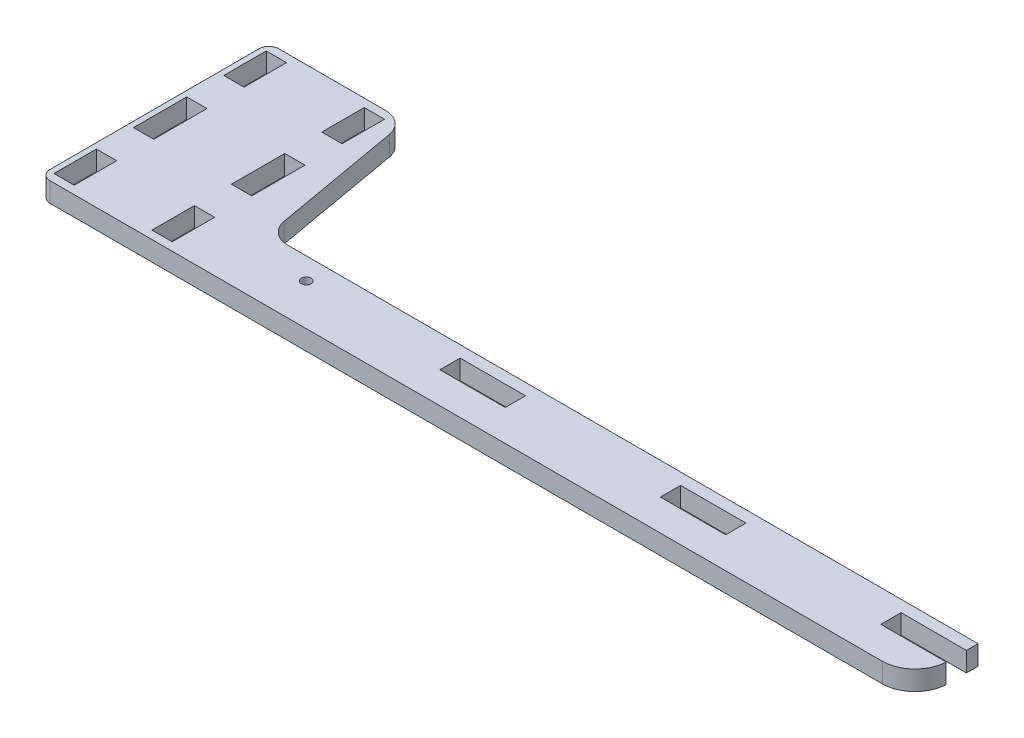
ISO-10303-21;
HEADER;
FILE_DESCRIPTION(('STEP AP214'),'2;1');
FILE_NAME('part.step','',(''),(''),'','','');
FILE_SCHEMA(('AUTOMOTIVE_DESIGN { 1 0 10303 214 1 1 1 1 }'));
ENDSEC;
DATA;
#1=APPLICATION_CONTEXT('core data for automotive mechanical design processes');
#2=APPLICATION_PROTOCOL_DEFINITION('international standard','automotive_design',2000,#1);
#3=PRODUCT_CONTEXT('',#1,'mechanical');
#4=PRODUCT('Part','Part','',(#3));
#5=PRODUCT_RELATED_PRODUCT_CATEGORY('part','',(#4));
#6=PRODUCT_DEFINITION_FORMATION('','',#4);
#7=PRODUCT_DEFINITION_CONTEXT('part definition',#1,'design');
#8=PRODUCT_DEFINITION('design','',#6,#7);
#9=PRODUCT_DEFINITION_SHAPE('','',#8);
#10=(LENGTH_UNIT() NAMED_UNIT(*) SI_UNIT(.MILLI.,.METRE.));
#11=(NAMED_UNIT(*) PLANE_ANGLE_UNIT() SI_UNIT($,.RADIAN.));
#12=(NAMED_UNIT(*) SI_UNIT($,.STERADIAN.) SOLID_ANGLE_UNIT());
#13=UNCERTAINTY_MEASURE_WITH_UNIT(LENGTH_MEASURE(1.E-05),#10,'distance_accuracy_value','');
#14=(GEOMETRIC_REPRESENTATION_CONTEXT(3) GLOBAL_UNCERTAINTY_ASSIGNED_CONTEXT((#13)) GLOBAL_UNIT_ASSIGNED_CONTEXT((#10,
#11,#12)) REPRESENTATION_CONTEXT('',''));
#15=CARTESIAN_POINT('',(0.,0.,0.));
#16=DIRECTION('',(0.,0.,1.));
#17=DIRECTION('',(1.,0.,0.));
#18=AXIS2_PLACEMENT_3D('',#15,#16,#17);
#19=CARTESIAN_POINT('',(0.,3.,0.));
#20=DIRECTION('',(0.,1.,0.));
#21=DIRECTION('',(0.,0.,1.));
#22=AXIS2_PLACEMENT_3D('',#19,#20,#21);
#23=PLANE('',#22);
#24=DIRECTION('',(-1.,0.,0.));
#25=VECTOR('',#24,1.);
#26=CARTESIAN_POINT('',(19.1,3.,-48.2));
#27=LINE('',#26,#25);
#28=CARTESIAN_POINT('',(12.9,3.,-48.2));
#29=VERTEX_POINT('',#28);
#30=CARTESIAN_POINT('',(19.1,3.,-48.2));
#31=VERTEX_POINT('',#30);
#32=EDGE_CURVE('E525',#29,#31,#27,.F.);
#33=ORIENTED_EDGE('',*,*,#32,.T.);
#34=DIRECTION('',(0.,0.,-1.));
#35=VECTOR('',#34,1.);
#36=CARTESIAN_POINT('',(19.1,3.,-35.2));
#37=LINE('',#36,#35);
#38=CARTESIAN_POINT('',(19.1,3.,-35.2));
#39=VERTEX_POINT('',#38);
#40=EDGE_CURVE('E541',#31,#39,#37,.F.);
#41=ORIENTED_EDGE('',*,*,#40,.T.);
#42=DIRECTION('',(1.,0.,0.));
#43=VECTOR('',#42,1.);
#44=CARTESIAN_POINT('',(12.9,3.,-35.2));
#45=LINE('',#44,#43);
#46=CARTESIAN_POINT('',(12.9,3.,-35.2));
#47=VERTEX_POINT('',#46);
#48=EDGE_CURVE('E536',#39,#47,#45,.F.);
#49=ORIENTED_EDGE('',*,*,#48,.T.);
#50=DIRECTION('',(0.,0.,1.));
#51=VECTOR('',#50,1.);
#52=CARTESIAN_POINT('',(12.9,3.,-48.2));
#53=LINE('',#52,#51);
#54=EDGE_CURVE('E530',#47,#29,#53,.F.);
#55=ORIENTED_EDGE('',*,*,#54,.T.);
#56=EDGE_LOOP('',(#33,#41,#49,#55));
#57=FACE_BOUND('',#56,.T.);
#58=DIRECTION('',(-1.,0.,0.));
#59=VECTOR('',#58,1.);
#60=CARTESIAN_POINT('',(19.1,3.,-23.85));
#61=LINE('',#60,#59);
#62=CARTESIAN_POINT('',(12.9,3.,-23.85));
#63=VERTEX_POINT('',#62);
#64=CARTESIAN_POINT('',(19.1,3.,-23.85));
#65=VERTEX_POINT('',#64);
#66=EDGE_CURVE('E547',#63,#65,#61,.F.);
#67=ORIENTED_EDGE('',*,*,#66,.T.);
#68=DIRECTION('',(0.,0.,-1.));
#69=VECTOR('',#68,1.);
#70=CARTESIAN_POINT('',(19.1,3.,-7.55));
#71=LINE('',#70,#69);
#72=CARTESIAN_POINT('',(19.1,3.,-7.55));
#73=VERTEX_POINT('',#72);
#74=EDGE_CURVE('E567',#65,#73,#71,.F.);
#75=ORIENTED_EDGE('',*,*,#74,.T.);
#76=DIRECTION('',(1.,0.,0.));
#77=VECTOR('',#76,1.);
#78=CARTESIAN_POINT('',(12.9,3.,-7.55));
#79=LINE('',#78,#77);
#80=CARTESIAN_POINT('',(12.9,3.,-7.55));
#81=VERTEX_POINT('',#80);
#82=EDGE_CURVE('E560',#73,#81,#79,.F.);
#83=ORIENTED_EDGE('',*,*,#82,.T.);
#84=DIRECTION('',(0.,0.,1.));
#85=VECTOR('',#84,1.);
#86=CARTESIAN_POINT('',(12.9,3.,-23.85));
#87=LINE('',#86,#85);
#88=EDGE_CURVE('E553',#81,#63,#87,.F.);
#89=ORIENTED_EDGE('',*,*,#88,.T.);
#90=EDGE_LOOP('',(#67,#75,#83,#89));
#91=FACE_BOUND('',#90,.T.);
#92=DIRECTION('',(-1.,0.,0.));
#93=VECTOR('',#92,1.);
#94=CARTESIAN_POINT('',(19.1,3.,3.8));
#95=LINE('',#94,#93);
#96=CARTESIAN_POINT('',(12.9,3.,3.8));
#97=VERTEX_POINT('',#96);
#98=CARTESIAN_POINT('',(19.1,3.,3.8));
#99=VERTEX_POINT('',#98);
#100=EDGE_CURVE('E574',#97,#99,#95,.F.);
#101=ORIENTED_EDGE('',*,*,#100,.T.);
#102=DIRECTION('',(0.,0.,-1.));
#103=VECTOR('',#102,1.);
#104=CARTESIAN_POINT('',(19.1,3.,16.8));
#105=LINE('',#104,#103);
#106=CARTESIAN_POINT('',(19.1,3.,16.8));
#107=VERTEX_POINT('',#106);
#108=EDGE_CURVE('E595',#99,#107,#105,.F.);
#109=ORIENTED_EDGE('',*,*,#108,.T.);
#110=DIRECTION('',(1.,0.,0.));
#111=VECTOR('',#110,1.);
#112=CARTESIAN_POINT('',(12.9,3.,16.8));
#113=LINE('',#112,#111);
#114=CARTESIAN_POINT('',(12.9,3.,16.8));
#115=VERTEX_POINT('',#114);
#116=EDGE_CURVE('E588',#107,#115,#113,.F.);
#117=ORIENTED_EDGE('',*,*,#116,.T.);
#118=DIRECTION('',(0.,0.,1.));
#119=VECTOR('',#118,1.);
#120=CARTESIAN_POINT('',(12.9,3.,3.8));
#121=LINE('',#120,#119);
#122=EDGE_CURVE('E581',#115,#97,#121,.F.);
#123=ORIENTED_EDGE('',*,*,#122,.T.);
#124=EDGE_LOOP('',(#101,#109,#117,#123));
#125=FACE_BOUND('',#124,.T.);
#126=DIRECTION('',(1.,0.,0.));
#127=VECTOR('',#126,1.);
#128=CARTESIAN_POINT('',(-17.1,3.,16.8));
#129=LINE('',#128,#127);
#130=CARTESIAN_POINT('',(-10.9,3.,16.8));
#131=VERTEX_POINT('',#130);
#132=CARTESIAN_POINT('',(-17.1,3.,16.8));
#133=VERTEX_POINT('',#132);
#134=EDGE_CURVE('E601',#131,#133,#129,.F.);
#135=ORIENTED_EDGE('',*,*,#134,.T.);
#136=DIRECTION('',(0.,0.,1.));
#137=VECTOR('',#136,1.);
#138=CARTESIAN_POINT('',(-17.1,3.,3.8));
#139=LINE('',#138,#137);
#140=CARTESIAN_POINT('',(-17.1,3.,3.8));
#141=VERTEX_POINT('',#140);
#142=EDGE_CURVE('E617',#133,#141,#139,.F.);
#143=ORIENTED_EDGE('',*,*,#142,.T.);
#144=DIRECTION('',(-1.,0.,0.));
#145=VECTOR('',#144,1.);
#146=CARTESIAN_POINT('',(-10.9,3.,3.8));
#147=LINE('',#146,#145);
#148=CARTESIAN_POINT('',(-10.9,3.,3.8));
#149=VERTEX_POINT('',#148);
#150=EDGE_CURVE('E612',#141,#149,#147,.F.);
#151=ORIENTED_EDGE('',*,*,#150,.T.);
#152=DIRECTION('',(0.,0.,-1.));
#153=VECTOR('',#152,1.);
#154=CARTESIAN_POINT('',(-10.9,3.,16.8));
#155=LINE('',#154,#153);
#156=EDGE_CURVE('E607',#149,#131,#155,.F.);
#157=ORIENTED_EDGE('',*,*,#156,.T.);
#158=EDGE_LOOP('',(#135,#143,#151,#157));
#159=FACE_BOUND('',#158,.T.);
#160=DIRECTION('',(1.,0.,0.));
#161=VECTOR('',#160,1.);
#162=CARTESIAN_POINT('',(-17.1,3.,-7.55));
#163=LINE('',#162,#161);
#164=CARTESIAN_POINT('',(-10.9,3.,-7.55));
#165=VERTEX_POINT('',#164);
#166=CARTESIAN_POINT('',(-17.1,3.,-7.55));
#167=VERTEX_POINT('',#166);
#168=EDGE_CURVE('E622',#165,#167,#163,.F.);
#169=ORIENTED_EDGE('',*,*,#168,.T.);
#170=DIRECTION('',(0.,0.,1.));
#171=VECTOR('',#170,1.);
#172=CARTESIAN_POINT('',(-17.1,3.,-23.85));
#173=LINE('',#172,#171);
#174=CARTESIAN_POINT('',(-17.1,3.,-23.85));
#175=VERTEX_POINT('',#174);
#176=EDGE_CURVE('E638',#167,#175,#173,.F.);
#177=ORIENTED_EDGE('',*,*,#176,.T.);
#178=DIRECTION('',(-1.,0.,0.));
#179=VECTOR('',#178,1.);
#180=CARTESIAN_POINT('',(-10.9,3.,-23.85));
#181=LINE('',#180,#179);
#182=CARTESIAN_POINT('',(-10.9,3.,-23.85));
#183=VERTEX_POINT('',#182);
#184=EDGE_CURVE('E633',#175,#183,#181,.F.);
#185=ORIENTED_EDGE('',*,*,#184,.T.);
#186=DIRECTION('',(0.,0.,-1.));
#187=VECTOR('',#186,1.);
#188=CARTESIAN_POINT('',(-10.9,3.,-7.55));
#189=LINE('',#188,#187);
#190=EDGE_CURVE('E628',#183,#165,#189,.F.);
#191=ORIENTED_EDGE('',*,*,#190,.T.);
#192=EDGE_LOOP('',(#169,#177,#185,#191));
#193=FACE_BOUND('',#192,.T.);
#194=DIRECTION('',(1.,0.,0.));
#195=VECTOR('',#194,1.);
#196=CARTESIAN_POINT('',(-17.1,3.,-35.2));
#197=LINE('',#196,#195);
#198=CARTESIAN_POINT('',(-10.9,3.,-35.2));
#199=VERTEX_POINT('',#198);
#200=CARTESIAN_POINT('',(-17.1,3.,-35.2));
#201=VERTEX_POINT('',#200);
#202=EDGE_CURVE('E643',#199,#201,#197,.F.);
#203=ORIENTED_EDGE('',*,*,#202,.T.);
#204=DIRECTION('',(0.,0.,1.));
#205=VECTOR('',#204,1.);
#206=CARTESIAN_POINT('',(-17.1,3.,-48.2));
#207=LINE('',#206,#205);
#208=CARTESIAN_POINT('',(-17.1,3.,-48.2));
#209=VERTEX_POINT('',#208);
#210=EDGE_CURVE('E659',#201,#209,#207,.F.);
#211=ORIENTED_EDGE('',*,*,#210,.T.);
#212=DIRECTION('',(-1.,0.,0.));
#213=VECTOR('',#212,1.);
#214=CARTESIAN_POINT('',(-10.9,3.,-48.2));
#215=LINE('',#214,#213);
#216=CARTESIAN_POINT('',(-10.9,3.,-48.2));
#217=VERTEX_POINT('',#216);
#218=EDGE_CURVE('E654',#209,#217,#215,.F.);
#219=ORIENTED_EDGE('',*,*,#218,.T.);
#220=DIRECTION('',(0.,0.,-1.));
#221=VECTOR('',#220,1.);
#222=CARTESIAN_POINT('',(-10.9,3.,-35.2));
#223=LINE('',#222,#221);
#224=EDGE_CURVE('E649',#217,#199,#223,.F.);
#225=ORIENTED_EDGE('',*,*,#224,.T.);
#226=EDGE_LOOP('',(#203,#211,#219,#225));
#227=FACE_BOUND('',#226,.T.);
#228=DIRECTION('',(0.,0.,-1.));
#229=VECTOR('',#228,1.);
#230=CARTESIAN_POINT('',(161.5,3.,9.75));
#231=LINE('',#230,#229);
#232=CARTESIAN_POINT('',(161.5,3.,3.55));
#233=VERTEX_POINT('',#232);
#234=CARTESIAN_POINT('',(161.5,3.,9.75));
#235=VERTEX_POINT('',#234);
#236=EDGE_CURVE('E664',#233,#235,#231,.F.);
#237=ORIENTED_EDGE('',*,*,#236,.F.);
#238=DIRECTION('',(1.,0.,0.));
#239=VECTOR('',#238,1.);
#240=CARTESIAN_POINT('',(161.5,3.,3.55));
#241=LINE('',#240,#239);
#242=CARTESIAN_POINT('',(181.5,3.,3.55));
#243=VERTEX_POINT('',#242);
#244=EDGE_CURVE('E682',#243,#233,#241,.F.);
#245=ORIENTED_EDGE('',*,*,#244,.F.);
#246=DIRECTION('',(0.,0.,1.));
#247=VECTOR('',#246,1.);
#248=CARTESIAN_POINT('',(181.5,3.,3.55));
#249=LINE('',#248,#247);
#250=CARTESIAN_POINT('',(181.5,3.,9.75));
#251=VERTEX_POINT('',#250);
#252=EDGE_CURVE('E679',#251,#243,#249,.F.);
#253=ORIENTED_EDGE('',*,*,#252,.F.);
#254=DIRECTION('',(-1.,0.,0.));
#255=VECTOR('',#254,1.);
#256=CARTESIAN_POINT('',(181.5,3.,9.75));
#257=LINE('',#256,#255);
#258=EDGE_CURVE('E674',#235,#251,#257,.F.);
#259=ORIENTED_EDGE('',*,*,#258,.F.);
#260=EDGE_LOOP('',(#237,#245,#253,#259));
#261=FACE_BOUND('',#260,.T.);
#262=DIRECTION('',(0.,0.,-1.));
#263=VECTOR('',#262,1.);
#264=CARTESIAN_POINT('',(94.,3.,9.75));
#265=LINE('',#264,#263);
#266=CARTESIAN_POINT('',(94.,3.,3.55));
#267=VERTEX_POINT('',#266);
#268=CARTESIAN_POINT('',(94.,3.,9.75));
#269=VERTEX_POINT('',#268);
#270=EDGE_CURVE('E687',#267,#269,#265,.F.);
#271=ORIENTED_EDGE('',*,*,#270,.F.);
#272=DIRECTION('',(1.,0.,0.));
#273=VECTOR('',#272,1.);
#274=CARTESIAN_POINT('',(94.,3.,3.55));
#275=LINE('',#274,#273);
#276=CARTESIAN_POINT('',(114.,3.,3.55));
#277=VERTEX_POINT('',#276);
#278=EDGE_CURVE('E448',#277,#267,#275,.F.);
#279=ORIENTED_EDGE('',*,*,#278,.F.);
#280=DIRECTION('',(0.,0.,1.));
#281=VECTOR('',#280,1.);
#282=CARTESIAN_POINT('',(114.,3.,3.55));
#283=LINE('',#282,#281);
#284=CARTESIAN_POINT('',(114.,3.,9.75));
#285=VERTEX_POINT('',#284);
#286=EDGE_CURVE('E703',#285,#277,#283,.F.);
#287=ORIENTED_EDGE('',*,*,#286,.F.);
#288=DIRECTION('',(-1.,0.,0.));
#289=VECTOR('',#288,1.);
#290=CARTESIAN_POINT('',(114.,3.,9.75));
#291=LINE('',#290,#289);
#292=EDGE_CURVE('E697',#269,#285,#291,.F.);
#293=ORIENTED_EDGE('',*,*,#292,.F.);
#294=EDGE_LOOP('',(#271,#279,#287,#293));
#295=FACE_BOUND('',#294,.T.);
#296=CARTESIAN_POINT('',(50.,3.,6.65));
#297=DIRECTION('',(0.,1.,0.));
#298=DIRECTION('',(0.,0.,1.));
#299=AXIS2_PLACEMENT_3D('',#296,#297,#298);
#300=CIRCLE('',#299,1.5);
#301=CARTESIAN_POINT('',(50.,3.,8.15));
#302=VERTEX_POINT('',#301);
#303=EDGE_CURVE('E377',#302,#302,#300,.F.);
#304=ORIENTED_EDGE('',*,*,#303,.T.);
#305=EDGE_LOOP('',(#304));
#306=FACE_BOUND('',#305,.T.);
#307=DIRECTION('',(-1.,0.,0.));
#308=VECTOR('',#307,1.);
#309=CARTESIAN_POINT('',(249.,3.,0.));
#310=LINE('',#309,#308);
#311=CARTESIAN_POINT('',(37.67369741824,3.,0.));
#312=VERTEX_POINT('',#311);
#313=CARTESIAN_POINT('',(249.,3.,0.));
#314=VERTEX_POINT('',#313);
#315=EDGE_CURVE('E361',#312,#314,#310,.F.);
#316=ORIENTED_EDGE('',*,*,#315,.F.);
#317=CARTESIAN_POINT('',(37.67369741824,3.,-7.));
#318=DIRECTION('',(0.,1.,0.));
#319=DIRECTION('',(0.,0.,1.));
#320=AXIS2_PLACEMENT_3D('',#317,#318,#319);
#321=CIRCLE('',#320,7.);
#322=CARTESIAN_POINT('',(30.7800431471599,3.,-5.7844627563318));
#323=VERTEX_POINT('',#322);
#324=EDGE_CURVE('E20',#312,#323,#321,.F.);
#325=ORIENTED_EDGE('',*,*,#324,.T.);
#326=DIRECTION('',(-0.173648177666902,0.,-0.984807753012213));
#327=VECTOR('',#326,1.);
#328=CARTESIAN_POINT('',(30.78004314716,3.,-5.784462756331));
#329=LINE('',#328,#327);
#330=CARTESIAN_POINT('',(23.880178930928,3.,-44.9155372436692));
#331=VERTEX_POINT('',#330);
#332=EDGE_CURVE('E358',#331,#323,#329,.F.);
#333=ORIENTED_EDGE('',*,*,#332,.F.);
#334=CARTESIAN_POINT('',(16.98652465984,3.,-43.7));
#335=DIRECTION('',(0.,1.,0.));
#336=DIRECTION('',(0.,0.,1.));
#337=AXIS2_PLACEMENT_3D('',#334,#335,#336);
#338=CIRCLE('',#337,7.);
#339=CARTESIAN_POINT('',(16.98652465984,3.,-50.7));
#340=VERTEX_POINT('',#339);
#341=EDGE_CURVE('E454',#340,#331,#338,.F.);
#342=ORIENTED_EDGE('',*,*,#341,.F.);
#343=DIRECTION('',(-1.,0.,0.));
#344=VECTOR('',#343,1.);
#345=CARTESIAN_POINT('',(16.98652465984,3.,-50.7));
#346=LINE('',#345,#344);
#347=CARTESIAN_POINT('',(-15.8,3.,-50.7));
#348=VERTEX_POINT('',#347);
#349=EDGE_CURVE('E410',#348,#340,#346,.F.);
#350=ORIENTED_EDGE('',*,*,#349,.F.);
#351=CARTESIAN_POINT('',(-15.8,3.,-47.7));
#352=DIRECTION('',(0.,1.,0.));
#353=DIRECTION('',(0.,0.,1.));
#354=AXIS2_PLACEMENT_3D('',#351,#352,#353);
#355=CIRCLE('',#354,3.);
#356=CARTESIAN_POINT('',(-18.8,3.,-47.7));
#357=VERTEX_POINT('',#356);
#358=EDGE_CURVE('E453',#357,#348,#355,.F.);
#359=ORIENTED_EDGE('',*,*,#358,.F.);
#360=DIRECTION('',(0.,0.,1.));
#361=VECTOR('',#360,1.);
#362=CARTESIAN_POINT('',(-18.8,3.,-47.7));
#363=LINE('',#362,#361);
#364=CARTESIAN_POINT('',(-18.8,3.,16.3));
#365=VERTEX_POINT('',#364);
#366=EDGE_CURVE('E406',#365,#357,#363,.F.);
#367=ORIENTED_EDGE('',*,*,#366,.F.);
#368=CARTESIAN_POINT('',(-15.8,3.,16.3));
#369=DIRECTION('',(0.,1.,0.));
#370=DIRECTION('',(0.,0.,1.));
#371=AXIS2_PLACEMENT_3D('',#368,#369,#370);
#372=CIRCLE('',#371,3.);
#373=CARTESIAN_POINT('',(-15.8,3.,19.3));
#374=VERTEX_POINT('',#373);
#375=EDGE_CURVE('E451',#374,#365,#372,.F.);
#376=ORIENTED_EDGE('',*,*,#375,.F.);
#377=DIRECTION('',(1.,0.,0.));
#378=VECTOR('',#377,1.);
#379=CARTESIAN_POINT('',(-15.8,3.,19.3));
#380=LINE('',#379,#378);
#381=CARTESIAN_POINT('',(239.,3.,19.3));
#382=VERTEX_POINT('',#381);
#383=EDGE_CURVE('E401',#382,#374,#380,.F.);
#384=ORIENTED_EDGE('',*,*,#383,.F.);
#385=CARTESIAN_POINT('',(239.,3.,9.3));
#386=DIRECTION('',(0.,1.,0.));
#387=DIRECTION('',(0.,0.,1.));
#388=AXIS2_PLACEMENT_3D('',#385,#386,#387);
#389=CIRCLE('',#388,10.);
#390=CARTESIAN_POINT('',(248.989869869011,3.,9.75));
#391=VERTEX_POINT('',#390);
#392=EDGE_CURVE('E449',#391,#382,#389,.F.);
#393=ORIENTED_EDGE('',*,*,#392,.F.);
#394=DIRECTION('',(-1.,0.,0.));
#395=VECTOR('',#394,1.);
#396=CARTESIAN_POINT('',(248.989869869,3.,9.75));
#397=LINE('',#396,#395);
#398=CARTESIAN_POINT('',(229.,3.,9.75));
#399=VERTEX_POINT('',#398);
#400=EDGE_CURVE('E396',#399,#391,#397,.F.);
#401=ORIENTED_EDGE('',*,*,#400,.F.);
#402=DIRECTION('',(0.,0.,-1.));
#403=VECTOR('',#402,1.);
#404=CARTESIAN_POINT('',(229.,3.,9.75));
#405=LINE('',#404,#403);
#406=CARTESIAN_POINT('',(229.,3.,3.55));
#407=VERTEX_POINT('',#406);
#408=EDGE_CURVE('E391',#407,#399,#405,.F.);
#409=ORIENTED_EDGE('',*,*,#408,.F.);
#410=DIRECTION('',(1.,0.,0.));
#411=VECTOR('',#410,1.);
#412=CARTESIAN_POINT('',(229.,3.,3.55));
#413=LINE('',#412,#411);
#414=CARTESIAN_POINT('',(249.,3.,3.55));
#415=VERTEX_POINT('',#414);
#416=EDGE_CURVE('E385',#415,#407,#413,.F.);
#417=ORIENTED_EDGE('',*,*,#416,.F.);
#418=DIRECTION('',(0.,0.,-1.));
#419=VECTOR('',#418,1.);
#420=CARTESIAN_POINT('',(249.,3.,3.55));
#421=LINE('',#420,#419);
#422=EDGE_CURVE('E369',#314,#415,#421,.F.);
#423=ORIENTED_EDGE('',*,*,#422,.F.);
#424=EDGE_LOOP('',(#316,#325,#333,#342,#350,#359,#367,#376,#384,#393,#401,#409,#417,#423));
#425=FACE_BOUND('',#424,.T.);
#426=ADVANCED_FACE('F17',(#57,#91,#125,#159,#193,#227,#261,#295,#306,#425),#23,.T.);
#427=CARTESIAN_POINT('',(37.67369741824,-3.,-7.));
#428=DIRECTION('',(0.,1.,0.));
#429=DIRECTION('',(0.,0.,1.));
#430=AXIS2_PLACEMENT_3D('',#427,#428,#429);
#431=CYLINDRICAL_SURFACE('',#430,7.);
#432=ORIENTED_EDGE('',*,*,#324,.F.);
#433=DIRECTION('',(0.,1.,0.));
#434=VECTOR('',#433,1.);
#435=CARTESIAN_POINT('',(37.67369741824,-3.,0.));
#436=LINE('',#435,#434);
#437=CARTESIAN_POINT('',(37.67369741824,-3.,0.));
#438=VERTEX_POINT('',#437);
#439=EDGE_CURVE('E351',#438,#312,#436,.T.);
#440=ORIENTED_EDGE('',*,*,#439,.F.);
#441=CARTESIAN_POINT('',(37.67369741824,-3.,-7.));
#442=DIRECTION('',(0.,1.,0.));
#443=DIRECTION('',(0.,0.,1.));
#444=AXIS2_PLACEMENT_3D('',#441,#442,#443);
#445=CIRCLE('',#444,7.);
#446=CARTESIAN_POINT('',(30.7800431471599,-3.,-5.78446275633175));
#447=VERTEX_POINT('',#446);
#448=EDGE_CURVE('E441',#438,#447,#445,.F.);
#449=ORIENTED_EDGE('',*,*,#448,.T.);
#450=DIRECTION('',(0.,1.,0.));
#451=VECTOR('',#450,1.);
#452=CARTESIAN_POINT('',(30.78004314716,-3.,-5.784462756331));
#453=LINE('',#452,#451);
#454=EDGE_CURVE('E353',#323,#447,#453,.F.);
#455=ORIENTED_EDGE('',*,*,#454,.F.);
#456=EDGE_LOOP('',(#432,#440,#449,#455));
#457=FACE_BOUND('',#456,.T.);
#458=ADVANCED_FACE('F349',(#457),#431,.F.);
#459=CARTESIAN_POINT('',(30.78004314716,-3.,-5.784462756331));
#460=DIRECTION('',(0.984807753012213,0.,-0.173648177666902));
#461=DIRECTION('',(-0.173648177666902,0.,-0.984807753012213));
#462=AXIS2_PLACEMENT_3D('',#459,#460,#461);
#463=PLANE('',#462);
#464=ORIENTED_EDGE('',*,*,#454,.T.);
#465=DIRECTION('',(-0.173648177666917,0.,-0.98480775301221));
#466=VECTOR('',#465,1.);
#467=CARTESIAN_POINT('',(30.78004314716,-3.,-5.784462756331));
#468=LINE('',#467,#466);
#469=CARTESIAN_POINT('',(23.8801789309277,-3.,-44.9155372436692));
#470=VERTEX_POINT('',#469);
#471=EDGE_CURVE('E440',#447,#470,#468,.T.);
#472=ORIENTED_EDGE('',*,*,#471,.T.);
#473=DIRECTION('',(0.,1.,0.));
#474=VECTOR('',#473,1.);
#475=CARTESIAN_POINT('',(23.8801789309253,-3.,-44.9155372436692));
#476=LINE('',#475,#474);
#477=EDGE_CURVE('E414',#331,#470,#476,.F.);
#478=ORIENTED_EDGE('',*,*,#477,.F.);
#479=ORIENTED_EDGE('',*,*,#332,.T.);
#480=EDGE_LOOP('',(#464,#472,#478,#479));
#481=FACE_BOUND('',#480,.T.);
#482=ADVANCED_FACE('F516',(#481),#463,.T.);
#483=CARTESIAN_POINT('',(16.98652465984,-3.,-43.7));
#484=DIRECTION('',(0.,1.,0.));
#485=DIRECTION('',(0.,0.,1.));
#486=AXIS2_PLACEMENT_3D('',#483,#484,#485);
#487=CYLINDRICAL_SURFACE('',#486,7.);
#488=ORIENTED_EDGE('',*,*,#477,.T.);
#489=CARTESIAN_POINT('',(16.98652465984,-3.,-43.7));
#490=DIRECTION('',(0.,1.,0.));
#491=DIRECTION('',(0.,0.,1.));
#492=AXIS2_PLACEMENT_3D('',#489,#490,#491);
#493=CIRCLE('',#492,7.);
#494=CARTESIAN_POINT('',(16.98652465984,-3.,-50.7));
#495=VERTEX_POINT('',#494);
#496=EDGE_CURVE('E436',#470,#495,#493,.T.);
#497=ORIENTED_EDGE('',*,*,#496,.T.);
#498=DIRECTION('',(0.,1.,0.));
#499=VECTOR('',#498,1.);
#500=CARTESIAN_POINT('',(16.98652465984,-3.,-50.7));
#501=LINE('',#500,#499);
#502=EDGE_CURVE('E413',#340,#495,#501,.F.);
#503=ORIENTED_EDGE('',*,*,#502,.F.);
#504=ORIENTED_EDGE('',*,*,#341,.T.);
#505=EDGE_LOOP('',(#488,#497,#503,#504));
#506=FACE_BOUND('',#505,.T.);
#507=ADVANCED_FACE('F514',(#506),#487,.T.);
#508=CARTESIAN_POINT('',(16.98652465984,-3.,-50.7));
#509=DIRECTION('',(0.,0.,-1.));
#510=DIRECTION('',(-1.,0.,0.));
#511=AXIS2_PLACEMENT_3D('',#508,#509,#510);
#512=PLANE('',#511);
#513=ORIENTED_EDGE('',*,*,#502,.T.);
#514=DIRECTION('',(1.,0.,0.));
#515=VECTOR('',#514,1.);
#516=CARTESIAN_POINT('',(0.,-3.,-50.7));
#517=LINE('',#516,#515);
#518=CARTESIAN_POINT('',(-15.8,-3.,-50.7));
#519=VERTEX_POINT('',#518);
#520=EDGE_CURVE('E435',#495,#519,#517,.F.);
#521=ORIENTED_EDGE('',*,*,#520,.T.);
#522=DIRECTION('',(0.,1.,0.));
#523=VECTOR('',#522,1.);
#524=CARTESIAN_POINT('',(-15.8,-3.,-50.7));
#525=LINE('',#524,#523);
#526=EDGE_CURVE('E409',#348,#519,#525,.F.);
#527=ORIENTED_EDGE('',*,*,#526,.F.);
#528=ORIENTED_EDGE('',*,*,#349,.T.);
#529=EDGE_LOOP('',(#513,#521,#527,#528));
#530=FACE_BOUND('',#529,.T.);
#531=ADVANCED_FACE('F503',(#530),#512,.T.);
#532=CARTESIAN_POINT('',(-15.8,-3.,-47.7));
#533=DIRECTION('',(0.,1.,0.));
#534=DIRECTION('',(0.,0.,1.));
#535=AXIS2_PLACEMENT_3D('',#532,#533,#534);
#536=CYLINDRICAL_SURFACE('',#535,3.);
#537=ORIENTED_EDGE('',*,*,#526,.T.);
#538=CARTESIAN_POINT('',(-15.8,-3.,-47.7));
#539=DIRECTION('',(0.,1.,0.));
#540=DIRECTION('',(0.,0.,1.));
#541=AXIS2_PLACEMENT_3D('',#538,#539,#540);
#542=CIRCLE('',#541,3.);
#543=CARTESIAN_POINT('',(-18.8,-3.,-47.7));
#544=VERTEX_POINT('',#543);
#545=EDGE_CURVE('E432',#519,#544,#542,.T.);
#546=ORIENTED_EDGE('',*,*,#545,.T.);
#547=DIRECTION('',(0.,1.,0.));
#548=VECTOR('',#547,1.);
#549=CARTESIAN_POINT('',(-18.8,-3.,-47.7));
#550=LINE('',#549,#548);
#551=EDGE_CURVE('E408',#357,#544,#550,.F.);
#552=ORIENTED_EDGE('',*,*,#551,.F.);
#553=ORIENTED_EDGE('',*,*,#358,.T.);
#554=EDGE_LOOP('',(#537,#546,#552,#553));
#555=FACE_BOUND('',#554,.T.);
#556=ADVANCED_FACE('F748',(#555),#536,.T.);
#557=CARTESIAN_POINT('',(-18.8,-3.,-47.7));
#558=DIRECTION('',(-1.,0.,0.));
#559=DIRECTION('',(0.,0.,1.));
#560=AXIS2_PLACEMENT_3D('',#557,#558,#559);
#561=PLANE('',#560);
#562=ORIENTED_EDGE('',*,*,#551,.T.);
#563=DIRECTION('',(0.,0.,1.));
#564=VECTOR('',#563,1.);
#565=CARTESIAN_POINT('',(-18.8,-3.,0.));
#566=LINE('',#565,#564);
#567=CARTESIAN_POINT('',(-18.8,-3.,16.3));
#568=VERTEX_POINT('',#567);
#569=EDGE_CURVE('E431',#544,#568,#566,.T.);
#570=ORIENTED_EDGE('',*,*,#569,.T.);
#571=DIRECTION('',(0.,1.,0.));
#572=VECTOR('',#571,1.);
#573=CARTESIAN_POINT('',(-18.8,-3.,16.3));
#574=LINE('',#573,#572);
#575=EDGE_CURVE('E405',#365,#568,#574,.F.);
#576=ORIENTED_EDGE('',*,*,#575,.F.);
#577=ORIENTED_EDGE('',*,*,#366,.T.);
#578=EDGE_LOOP('',(#562,#570,#576,#577));
#579=FACE_BOUND('',#578,.T.);
#580=ADVANCED_FACE('F743',(#579),#561,.T.);
#581=CARTESIAN_POINT('',(-15.8,-3.,16.3));
#582=DIRECTION('',(0.,1.,0.));
#583=DIRECTION('',(0.,0.,1.));
#584=AXIS2_PLACEMENT_3D('',#581,#582,#583);
#585=CYLINDRICAL_SURFACE('',#584,3.);
#586=ORIENTED_EDGE('',*,*,#575,.T.);
#587=CARTESIAN_POINT('',(-15.8,-3.,16.3));
#588=DIRECTION('',(0.,1.,0.));
#589=DIRECTION('',(0.,0.,1.));
#590=AXIS2_PLACEMENT_3D('',#587,#588,#589);
#591=CIRCLE('',#590,3.);
#592=CARTESIAN_POINT('',(-15.8,-3.,19.3));
#593=VERTEX_POINT('',#592);
#594=EDGE_CURVE('E428',#568,#593,#591,.T.);
#595=ORIENTED_EDGE('',*,*,#594,.T.);
#596=DIRECTION('',(0.,1.,0.));
#597=VECTOR('',#596,1.);
#598=CARTESIAN_POINT('',(-15.8,-3.,19.3));
#599=LINE('',#598,#597);
#600=EDGE_CURVE('E404',#374,#593,#599,.F.);
#601=ORIENTED_EDGE('',*,*,#600,.F.);
#602=ORIENTED_EDGE('',*,*,#375,.T.);
#603=EDGE_LOOP('',(#586,#595,#601,#602));
#604=FACE_BOUND('',#603,.T.);
#605=ADVANCED_FACE('F756',(#604),#585,.T.);
#606=CARTESIAN_POINT('',(-15.8,-3.,19.3));
#607=DIRECTION('',(0.,0.,1.));
#608=DIRECTION('',(1.,0.,0.));
#609=AXIS2_PLACEMENT_3D('',#606,#607,#608);
#610=PLANE('',#609);
#611=ORIENTED_EDGE('',*,*,#600,.T.);
#612=DIRECTION('',(1.,0.,0.));
#613=VECTOR('',#612,1.);
#614=CARTESIAN_POINT('',(0.,-3.,19.3));
#615=LINE('',#614,#613);
#616=CARTESIAN_POINT('',(239.,-3.,19.3));
#617=VERTEX_POINT('',#616);
#618=EDGE_CURVE('E427',#593,#617,#615,.T.);
#619=ORIENTED_EDGE('',*,*,#618,.T.);
#620=DIRECTION('',(0.,1.,0.));
#621=VECTOR('',#620,1.);
#622=CARTESIAN_POINT('',(239.,-3.,19.3));
#623=LINE('',#622,#621);
#624=EDGE_CURVE('E398',#382,#617,#623,.F.);
#625=ORIENTED_EDGE('',*,*,#624,.F.);
#626=ORIENTED_EDGE('',*,*,#383,.T.);
#627=EDGE_LOOP('',(#611,#619,#625,#626));
#628=FACE_BOUND('',#627,.T.);
#629=ADVANCED_FACE('F758',(#628),#610,.T.);
#630=CARTESIAN_POINT('',(239.,-3.,9.3));
#631=DIRECTION('',(0.,1.,0.));
#632=DIRECTION('',(0.,0.,1.));
#633=AXIS2_PLACEMENT_3D('',#630,#631,#632);
#634=CYLINDRICAL_SURFACE('',#633,10.);
#635=ORIENTED_EDGE('',*,*,#624,.T.);
#636=CARTESIAN_POINT('',(239.,-3.,9.3));
#637=DIRECTION('',(0.,1.,0.));
#638=DIRECTION('',(0.,0.,1.));
#639=AXIS2_PLACEMENT_3D('',#636,#637,#638);
#640=CIRCLE('',#639,10.);
#641=CARTESIAN_POINT('',(248.989869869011,-3.,9.75));
#642=VERTEX_POINT('',#641);
#643=EDGE_CURVE('E423',#617,#642,#640,.T.);
#644=ORIENTED_EDGE('',*,*,#643,.T.);
#645=DIRECTION('',(0.,1.,0.));
#646=VECTOR('',#645,1.);
#647=CARTESIAN_POINT('',(248.989869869,-3.,9.75));
#648=LINE('',#647,#646);
#649=EDGE_CURVE('E393',#391,#642,#648,.F.);
#650=ORIENTED_EDGE('',*,*,#649,.F.);
#651=ORIENTED_EDGE('',*,*,#392,.T.);
#652=EDGE_LOOP('',(#635,#644,#650,#651));
#653=FACE_BOUND('',#652,.T.);
#654=ADVANCED_FACE('F760',(#653),#634,.T.);
#655=CARTESIAN_POINT('',(248.989869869,-3.,9.75));
#656=DIRECTION('',(0.,0.,-1.));
#657=DIRECTION('',(-1.,0.,0.));
#658=AXIS2_PLACEMENT_3D('',#655,#656,#657);
#659=PLANE('',#658);
#660=ORIENTED_EDGE('',*,*,#649,.T.);
#661=DIRECTION('',(1.,0.,0.));
#662=VECTOR('',#661,1.);
#663=CARTESIAN_POINT('',(0.,-3.,9.75));
#664=LINE('',#663,#662);
#665=CARTESIAN_POINT('',(229.,-3.,9.75));
#666=VERTEX_POINT('',#665);
#667=EDGE_CURVE('E426',#642,#666,#664,.F.);
#668=ORIENTED_EDGE('',*,*,#667,.T.);
#669=DIRECTION('',(0.,1.,0.));
#670=VECTOR('',#669,1.);
#671=CARTESIAN_POINT('',(229.,-3.,9.75));
#672=LINE('',#671,#670);
#673=EDGE_CURVE('E388',#399,#666,#672,.F.);
#674=ORIENTED_EDGE('',*,*,#673,.F.);
#675=ORIENTED_EDGE('',*,*,#400,.T.);
#676=EDGE_LOOP('',(#660,#668,#674,#675));
#677=FACE_BOUND('',#676,.T.);
#678=ADVANCED_FACE('F727',(#677),#659,.T.);
#679=CARTESIAN_POINT('',(229.,-3.,9.75));
#680=DIRECTION('',(1.,0.,0.));
#681=DIRECTION('',(0.,0.,-1.));
#682=AXIS2_PLACEMENT_3D('',#679,#680,#681);
#683=PLANE('',#682);
#684=ORIENTED_EDGE('',*,*,#673,.T.);
#685=DIRECTION('',(0.,0.,1.));
#686=VECTOR('',#685,1.);
#687=CARTESIAN_POINT('',(229.,-3.,0.));
#688=LINE('',#687,#686);
#689=CARTESIAN_POINT('',(229.,-3.,3.55));
#690=VERTEX_POINT('',#689);
#691=EDGE_CURVE('E483',#666,#690,#688,.F.);
#692=ORIENTED_EDGE('',*,*,#691,.T.);
#693=DIRECTION('',(0.,1.,0.));
#694=VECTOR('',#693,1.);
#695=CARTESIAN_POINT('',(229.,-3.,3.55));
#696=LINE('',#695,#694);
#697=EDGE_CURVE('E387',#407,#690,#696,.F.);
#698=ORIENTED_EDGE('',*,*,#697,.F.);
#699=ORIENTED_EDGE('',*,*,#408,.T.);
#700=EDGE_LOOP('',(#684,#692,#698,#699));
#701=FACE_BOUND('',#700,.T.);
#702=ADVANCED_FACE('F722',(#701),#683,.T.);
#703=CARTESIAN_POINT('',(229.,-3.,3.55));
#704=DIRECTION('',(0.,0.,1.));
#705=DIRECTION('',(1.,0.,0.));
#706=AXIS2_PLACEMENT_3D('',#703,#704,#705);
#707=PLANE('',#706);
#708=ORIENTED_EDGE('',*,*,#697,.T.);
#709=DIRECTION('',(1.,0.,0.));
#710=VECTOR('',#709,1.);
#711=CARTESIAN_POINT('',(0.,-3.,3.55));
#712=LINE('',#711,#710);
#713=CARTESIAN_POINT('',(249.,-3.,3.55));
#714=VERTEX_POINT('',#713);
#715=EDGE_CURVE('E486',#690,#714,#712,.T.);
#716=ORIENTED_EDGE('',*,*,#715,.T.);
#717=DIRECTION('',(0.,1.,0.));
#718=VECTOR('',#717,1.);
#719=CARTESIAN_POINT('',(249.,-3.,3.55));
#720=LINE('',#719,#718);
#721=EDGE_CURVE('E366',#415,#714,#720,.F.);
#722=ORIENTED_EDGE('',*,*,#721,.F.);
#723=ORIENTED_EDGE('',*,*,#416,.T.);
#724=EDGE_LOOP('',(#708,#716,#722,#723));
#725=FACE_BOUND('',#724,.T.);
#726=ADVANCED_FACE('F717',(#725),#707,.T.);
#727=CARTESIAN_POINT('',(249.,-3.,3.55));
#728=DIRECTION('',(1.,0.,0.));
#729=DIRECTION('',(0.,0.,-1.));
#730=AXIS2_PLACEMENT_3D('',#727,#728,#729);
#731=PLANE('',#730);
#732=ORIENTED_EDGE('',*,*,#721,.T.);
#733=DIRECTION('',(0.,0.,1.));
#734=VECTOR('',#733,1.);
#735=CARTESIAN_POINT('',(249.,-3.,0.));
#736=LINE('',#735,#734);
#737=CARTESIAN_POINT('',(249.,-3.,0.));
#738=VERTEX_POINT('',#737);
#739=EDGE_CURVE('E710',#714,#738,#736,.F.);
#740=ORIENTED_EDGE('',*,*,#739,.T.);
#741=DIRECTION('',(0.,1.,0.));
#742=VECTOR('',#741,1.);
#743=CARTESIAN_POINT('',(249.,-3.,0.));
#744=LINE('',#743,#742);
#745=EDGE_CURVE('E372',#314,#738,#744,.F.);
#746=ORIENTED_EDGE('',*,*,#745,.F.);
#747=ORIENTED_EDGE('',*,*,#422,.T.);
#748=EDGE_LOOP('',(#732,#740,#746,#747));
#749=FACE_BOUND('',#748,.T.);
#750=ADVANCED_FACE('F912',(#749),#731,.T.);
#751=CARTESIAN_POINT('',(249.,-3.,0.));
#752=DIRECTION('',(0.,0.,-1.));
#753=DIRECTION('',(-1.,0.,0.));
#754=AXIS2_PLACEMENT_3D('',#751,#752,#753);
#755=PLANE('',#754);
#756=ORIENTED_EDGE('',*,*,#745,.T.);
#757=DIRECTION('',(1.,0.,0.));
#758=VECTOR('',#757,1.);
#759=CARTESIAN_POINT('',(0.,-3.,0.));
#760=LINE('',#759,#758);
#761=EDGE_CURVE('E364',#738,#438,#760,.F.);
#762=ORIENTED_EDGE('',*,*,#761,.T.);
#763=ORIENTED_EDGE('',*,*,#439,.T.);
#764=ORIENTED_EDGE('',*,*,#315,.T.);
#765=EDGE_LOOP('',(#756,#762,#763,#764));
#766=FACE_BOUND('',#765,.T.);
#767=ADVANCED_FACE('F360',(#766),#755,.T.);
#768=CARTESIAN_POINT('',(50.,-3.,6.65));
#769=DIRECTION('',(0.,1.,0.));
#770=DIRECTION('',(0.,0.,1.));
#771=AXIS2_PLACEMENT_3D('',#768,#769,#770);
#772=CYLINDRICAL_SURFACE('',#771,1.5);
#773=ORIENTED_EDGE('',*,*,#303,.F.);
#774=EDGE_LOOP('',(#773));
#775=FACE_BOUND('',#774,.T.);
#776=CARTESIAN_POINT('',(50.,-3.,6.65));
#777=DIRECTION('',(0.,1.,0.));
#778=DIRECTION('',(0.,0.,1.));
#779=AXIS2_PLACEMENT_3D('',#776,#777,#778);
#780=CIRCLE('',#779,1.5);
#781=CARTESIAN_POINT('',(50.,-3.,8.15));
#782=VERTEX_POINT('',#781);
#783=EDGE_CURVE('E418',#782,#782,#780,.F.);
#784=ORIENTED_EDGE('',*,*,#783,.T.);
#785=EDGE_LOOP('',(#784));
#786=FACE_BOUND('',#785,.T.);
#787=ADVANCED_FACE('F906',(#775,#786),#772,.F.);
#788=CARTESIAN_POINT('',(94.,-3.,3.55));
#789=DIRECTION('',(0.,0.,1.));
#790=DIRECTION('',(1.,0.,0.));
#791=AXIS2_PLACEMENT_3D('',#788,#789,#790);
#792=PLANE('',#791);
#793=DIRECTION('',(0.,1.,0.));
#794=VECTOR('',#793,1.);
#795=CARTESIAN_POINT('',(94.,-3.,3.55));
#796=LINE('',#795,#794);
#797=CARTESIAN_POINT('',(94.,-3.,3.55));
#798=VERTEX_POINT('',#797);
#799=EDGE_CURVE('E690',#798,#267,#796,.T.);
#800=ORIENTED_EDGE('',*,*,#799,.F.);
#801=DIRECTION('',(1.,0.,0.));
#802=VECTOR('',#801,1.);
#803=CARTESIAN_POINT('',(0.,-3.,3.55));
#804=LINE('',#803,#802);
#805=CARTESIAN_POINT('',(114.,-3.,3.55));
#806=VERTEX_POINT('',#805);
#807=EDGE_CURVE('E422',#798,#806,#804,.T.);
#808=ORIENTED_EDGE('',*,*,#807,.T.);
#809=DIRECTION('',(0.,1.,0.));
#810=VECTOR('',#809,1.);
#811=CARTESIAN_POINT('',(114.,-3.,3.55));
#812=LINE('',#811,#810);
#813=EDGE_CURVE('E700',#277,#806,#812,.F.);
#814=ORIENTED_EDGE('',*,*,#813,.F.);
#815=ORIENTED_EDGE('',*,*,#278,.T.);
#816=EDGE_LOOP('',(#800,#808,#814,#815));
#817=FACE_BOUND('',#816,.T.);
#818=ADVANCED_FACE('F902',(#817),#792,.T.);
#819=CARTESIAN_POINT('',(114.,-3.,3.55));
#820=DIRECTION('',(-1.,0.,0.));
#821=DIRECTION('',(0.,0.,1.));
#822=AXIS2_PLACEMENT_3D('',#819,#820,#821);
#823=PLANE('',#822);
#824=ORIENTED_EDGE('',*,*,#813,.T.);
#825=DIRECTION('',(0.,0.,1.));
#826=VECTOR('',#825,1.);
#827=CARTESIAN_POINT('',(114.,-3.,0.));
#828=LINE('',#827,#826);
#829=CARTESIAN_POINT('',(114.,-3.,9.75));
#830=VERTEX_POINT('',#829);
#831=EDGE_CURVE('E1169',#806,#830,#828,.T.);
#832=ORIENTED_EDGE('',*,*,#831,.T.);
#833=DIRECTION('',(0.,1.,0.));
#834=VECTOR('',#833,1.);
#835=CARTESIAN_POINT('',(114.,-3.,9.75));
#836=LINE('',#835,#834);
#837=EDGE_CURVE('E694',#285,#830,#836,.F.);
#838=ORIENTED_EDGE('',*,*,#837,.F.);
#839=ORIENTED_EDGE('',*,*,#286,.T.);
#840=EDGE_LOOP('',(#824,#832,#838,#839));
#841=FACE_BOUND('',#840,.T.);
#842=ADVANCED_FACE('F898',(#841),#823,.T.);
#843=CARTESIAN_POINT('',(114.,-3.,9.75));
#844=DIRECTION('',(0.,0.,-1.));
#845=DIRECTION('',(-1.,0.,0.));
#846=AXIS2_PLACEMENT_3D('',#843,#844,#845);
#847=PLANE('',#846);
#848=ORIENTED_EDGE('',*,*,#837,.T.);
#849=DIRECTION('',(1.,0.,0.));
#850=VECTOR('',#849,1.);
#851=CARTESIAN_POINT('',(0.,-3.,9.75));
#852=LINE('',#851,#850);
#853=CARTESIAN_POINT('',(94.,-3.,9.75));
#854=VERTEX_POINT('',#853);
#855=EDGE_CURVE('E1173',#830,#854,#852,.F.);
#856=ORIENTED_EDGE('',*,*,#855,.T.);
#857=DIRECTION('',(0.,1.,0.));
#858=VECTOR('',#857,1.);
#859=CARTESIAN_POINT('',(94.,-3.,9.75));
#860=LINE('',#859,#858);
#861=EDGE_CURVE('E684',#269,#854,#860,.F.);
#862=ORIENTED_EDGE('',*,*,#861,.F.);
#863=ORIENTED_EDGE('',*,*,#292,.T.);
#864=EDGE_LOOP('',(#848,#856,#862,#863));
#865=FACE_BOUND('',#864,.T.);
#866=ADVANCED_FACE('F894',(#865),#847,.T.);
#867=CARTESIAN_POINT('',(94.,-3.,9.75));
#868=DIRECTION('',(1.,0.,0.));
#869=DIRECTION('',(0.,0.,-1.));
#870=AXIS2_PLACEMENT_3D('',#867,#868,#869);
#871=PLANE('',#870);
#872=ORIENTED_EDGE('',*,*,#861,.T.);
#873=DIRECTION('',(0.,0.,1.));
#874=VECTOR('',#873,1.);
#875=CARTESIAN_POINT('',(94.,-3.,0.));
#876=LINE('',#875,#874);
#877=EDGE_CURVE('E1164',#854,#798,#876,.F.);
#878=ORIENTED_EDGE('',*,*,#877,.T.);
#879=ORIENTED_EDGE('',*,*,#799,.T.);
#880=ORIENTED_EDGE('',*,*,#270,.T.);
#881=EDGE_LOOP('',(#872,#878,#879,#880));
#882=FACE_BOUND('',#881,.T.);
#883=ADVANCED_FACE('F890',(#882),#871,.T.);
#884=CARTESIAN_POINT('',(161.5,-3.,3.55));
#885=DIRECTION('',(0.,0.,1.));
#886=DIRECTION('',(1.,0.,0.));
#887=AXIS2_PLACEMENT_3D('',#884,#885,#886);
#888=PLANE('',#887);
#889=DIRECTION('',(0.,1.,0.));
#890=VECTOR('',#889,1.);
#891=CARTESIAN_POINT('',(161.5,-3.,3.55));
#892=LINE('',#891,#890);
#893=CARTESIAN_POINT('',(161.5,-3.,3.55));
#894=VERTEX_POINT('',#893);
#895=EDGE_CURVE('E667',#894,#233,#892,.T.);
#896=ORIENTED_EDGE('',*,*,#895,.F.);
#897=DIRECTION('',(1.,0.,0.));
#898=VECTOR('',#897,1.);
#899=CARTESIAN_POINT('',(0.,-3.,3.55));
#900=LINE('',#899,#898);
#901=CARTESIAN_POINT('',(181.5,-3.,3.55));
#902=VERTEX_POINT('',#901);
#903=EDGE_CURVE('E1186',#894,#902,#900,.T.);
#904=ORIENTED_EDGE('',*,*,#903,.T.);
#905=DIRECTION('',(0.,1.,0.));
#906=VECTOR('',#905,1.);
#907=CARTESIAN_POINT('',(181.5,-3.,3.55));
#908=LINE('',#907,#906);
#909=EDGE_CURVE('E676',#243,#902,#908,.F.);
#910=ORIENTED_EDGE('',*,*,#909,.F.);
#911=ORIENTED_EDGE('',*,*,#244,.T.);
#912=EDGE_LOOP('',(#896,#904,#910,#911));
#913=FACE_BOUND('',#912,.T.);
#914=ADVANCED_FACE('F886',(#913),#888,.T.);
#915=CARTESIAN_POINT('',(181.5,-3.,3.55));
#916=DIRECTION('',(-1.,0.,0.));
#917=DIRECTION('',(0.,0.,1.));
#918=AXIS2_PLACEMENT_3D('',#915,#916,#917);
#919=PLANE('',#918);
#920=ORIENTED_EDGE('',*,*,#909,.T.);
#921=DIRECTION('',(0.,0.,1.));
#922=VECTOR('',#921,1.);
#923=CARTESIAN_POINT('',(181.5,-3.,0.));
#924=LINE('',#923,#922);
#925=CARTESIAN_POINT('',(181.5,-3.,9.75));
#926=VERTEX_POINT('',#925);
#927=EDGE_CURVE('E1191',#902,#926,#924,.T.);
#928=ORIENTED_EDGE('',*,*,#927,.T.);
#929=DIRECTION('',(0.,1.,0.));
#930=VECTOR('',#929,1.);
#931=CARTESIAN_POINT('',(181.5,-3.,9.75));
#932=LINE('',#931,#930);
#933=EDGE_CURVE('E671',#251,#926,#932,.F.);
#934=ORIENTED_EDGE('',*,*,#933,.F.);
#935=ORIENTED_EDGE('',*,*,#252,.T.);
#936=EDGE_LOOP('',(#920,#928,#934,#935));
#937=FACE_BOUND('',#936,.T.);
#938=ADVANCED_FACE('F882',(#937),#919,.T.);
#939=CARTESIAN_POINT('',(181.5,-3.,9.75));
#940=DIRECTION('',(0.,0.,-1.));
#941=DIRECTION('',(-1.,0.,0.));
#942=AXIS2_PLACEMENT_3D('',#939,#940,#941);
#943=PLANE('',#942);
#944=ORIENTED_EDGE('',*,*,#933,.T.);
#945=DIRECTION('',(1.,0.,0.));
#946=VECTOR('',#945,1.);
#947=CARTESIAN_POINT('',(0.,-3.,9.75));
#948=LINE('',#947,#946);
#949=CARTESIAN_POINT('',(161.5,-3.,9.75));
#950=VERTEX_POINT('',#949);
#951=EDGE_CURVE('E1188',#926,#950,#948,.F.);
#952=ORIENTED_EDGE('',*,*,#951,.T.);
#953=DIRECTION('',(0.,1.,0.));
#954=VECTOR('',#953,1.);
#955=CARTESIAN_POINT('',(161.5,-3.,9.75));
#956=LINE('',#955,#954);
#957=EDGE_CURVE('E661',#235,#950,#956,.F.);
#958=ORIENTED_EDGE('',*,*,#957,.F.);
#959=ORIENTED_EDGE('',*,*,#258,.T.);
#960=EDGE_LOOP('',(#944,#952,#958,#959));
#961=FACE_BOUND('',#960,.T.);
#962=ADVANCED_FACE('F878',(#961),#943,.T.);
#963=CARTESIAN_POINT('',(161.5,-3.,9.75));
#964=DIRECTION('',(1.,0.,0.));
#965=DIRECTION('',(0.,0.,-1.));
#966=AXIS2_PLACEMENT_3D('',#963,#964,#965);
#967=PLANE('',#966);
#968=ORIENTED_EDGE('',*,*,#957,.T.);
#969=DIRECTION('',(0.,0.,1.));
#970=VECTOR('',#969,1.);
#971=CARTESIAN_POINT('',(161.5,-3.,0.));
#972=LINE('',#971,#970);
#973=EDGE_CURVE('E1190',#950,#894,#972,.F.);
#974=ORIENTED_EDGE('',*,*,#973,.T.);
#975=ORIENTED_EDGE('',*,*,#895,.T.);
#976=ORIENTED_EDGE('',*,*,#236,.T.);
#977=EDGE_LOOP('',(#968,#974,#975,#976));
#978=FACE_BOUND('',#977,.T.);
#979=ADVANCED_FACE('F874',(#978),#967,.T.);
#980=CARTESIAN_POINT('',(-17.1,3.,-48.2));
#981=DIRECTION('',(-1.,0.,0.));
#982=DIRECTION('',(0.,0.,1.));
#983=AXIS2_PLACEMENT_3D('',#980,#981,#982);
#984=PLANE('',#983);
#985=ORIENTED_EDGE('',*,*,#210,.F.);
#986=DIRECTION('',(0.,1.,0.));
#987=VECTOR('',#986,1.);
#988=CARTESIAN_POINT('',(-17.1,3.,-35.2));
#989=LINE('',#988,#987);
#990=CARTESIAN_POINT('',(-17.1,-3.,-35.2));
#991=VERTEX_POINT('',#990);
#992=EDGE_CURVE('E640',#201,#991,#989,.F.);
#993=ORIENTED_EDGE('',*,*,#992,.T.);
#994=DIRECTION('',(0.,0.,1.));
#995=VECTOR('',#994,1.);
#996=CARTESIAN_POINT('',(-17.1,-3.,0.));
#997=LINE('',#996,#995);
#998=CARTESIAN_POINT('',(-17.1,-3.,-48.2));
#999=VERTEX_POINT('',#998);
#1000=EDGE_CURVE('E1197',#991,#999,#997,.F.);
#1001=ORIENTED_EDGE('',*,*,#1000,.T.);
#1002=DIRECTION('',(0.,1.,0.));
#1003=VECTOR('',#1002,1.);
#1004=CARTESIAN_POINT('',(-17.1,3.,-48.2));
#1005=LINE('',#1004,#1003);
#1006=EDGE_CURVE('E656',#999,#209,#1005,.T.);
#1007=ORIENTED_EDGE('',*,*,#1006,.T.);
#1008=EDGE_LOOP('',(#985,#993,#1001,#1007));
#1009=FACE_BOUND('',#1008,.T.);
#1010=ADVANCED_FACE('F870',(#1009),#984,.F.);
#1011=CARTESIAN_POINT('',(-10.9,3.,-48.2));
#1012=DIRECTION('',(0.,0.,-1.));
#1013=DIRECTION('',(-1.,0.,0.));
#1014=AXIS2_PLACEMENT_3D('',#1011,#1012,#1013);
#1015=PLANE('',#1014);
#1016=ORIENTED_EDGE('',*,*,#218,.F.);
#1017=ORIENTED_EDGE('',*,*,#1006,.F.);
#1018=DIRECTION('',(1.,0.,0.));
#1019=VECTOR('',#1018,1.);
#1020=CARTESIAN_POINT('',(0.,-3.,-48.2));
#1021=LINE('',#1020,#1019);
#1022=CARTESIAN_POINT('',(-10.9,-3.,-48.2));
#1023=VERTEX_POINT('',#1022);
#1024=EDGE_CURVE('E1214',#999,#1023,#1021,.T.);
#1025=ORIENTED_EDGE('',*,*,#1024,.T.);
#1026=DIRECTION('',(0.,1.,0.));
#1027=VECTOR('',#1026,1.);
#1028=CARTESIAN_POINT('',(-10.9,3.,-48.2));
#1029=LINE('',#1028,#1027);
#1030=EDGE_CURVE('E651',#1023,#217,#1029,.T.);
#1031=ORIENTED_EDGE('',*,*,#1030,.T.);
#1032=EDGE_LOOP('',(#1016,#1017,#1025,#1031));
#1033=FACE_BOUND('',#1032,.T.);
#1034=ADVANCED_FACE('F866',(#1033),#1015,.F.);
#1035=CARTESIAN_POINT('',(-10.9,3.,-35.2));
#1036=DIRECTION('',(1.,0.,0.));
#1037=DIRECTION('',(0.,0.,-1.));
#1038=AXIS2_PLACEMENT_3D('',#1035,#1036,#1037);
#1039=PLANE('',#1038);
#1040=ORIENTED_EDGE('',*,*,#224,.F.);
#1041=ORIENTED_EDGE('',*,*,#1030,.F.);
#1042=DIRECTION('',(0.,0.,1.));
#1043=VECTOR('',#1042,1.);
#1044=CARTESIAN_POINT('',(-10.9,-3.,0.));
#1045=LINE('',#1044,#1043);
#1046=CARTESIAN_POINT('',(-10.9,-3.,-35.2));
#1047=VERTEX_POINT('',#1046);
#1048=EDGE_CURVE('E1217',#1023,#1047,#1045,.T.);
#1049=ORIENTED_EDGE('',*,*,#1048,.T.);
#1050=DIRECTION('',(0.,1.,0.));
#1051=VECTOR('',#1050,1.);
#1052=CARTESIAN_POINT('',(-10.9,3.,-35.2));
#1053=LINE('',#1052,#1051);
#1054=EDGE_CURVE('E646',#1047,#199,#1053,.T.);
#1055=ORIENTED_EDGE('',*,*,#1054,.T.);
#1056=EDGE_LOOP('',(#1040,#1041,#1049,#1055));
#1057=FACE_BOUND('',#1056,.T.);
#1058=ADVANCED_FACE('F862',(#1057),#1039,.F.);
#1059=CARTESIAN_POINT('',(-17.1,3.,-35.2));
#1060=DIRECTION('',(0.,0.,1.));
#1061=DIRECTION('',(1.,0.,0.));
#1062=AXIS2_PLACEMENT_3D('',#1059,#1060,#1061);
#1063=PLANE('',#1062);
#1064=ORIENTED_EDGE('',*,*,#202,.F.);
#1065=ORIENTED_EDGE('',*,*,#1054,.F.);
#1066=DIRECTION('',(1.,0.,0.));
#1067=VECTOR('',#1066,1.);
#1068=CARTESIAN_POINT('',(0.,-3.,-35.2));
#1069=LINE('',#1068,#1067);
#1070=EDGE_CURVE('E1220',#1047,#991,#1069,.F.);
#1071=ORIENTED_EDGE('',*,*,#1070,.T.);
#1072=ORIENTED_EDGE('',*,*,#992,.F.);
#1073=EDGE_LOOP('',(#1064,#1065,#1071,#1072));
#1074=FACE_BOUND('',#1073,.T.);
#1075=ADVANCED_FACE('F858',(#1074),#1063,.F.);
#1076=CARTESIAN_POINT('',(-17.1,3.,-23.85));
#1077=DIRECTION('',(-1.,0.,0.));
#1078=DIRECTION('',(0.,0.,1.));
#1079=AXIS2_PLACEMENT_3D('',#1076,#1077,#1078);
#1080=PLANE('',#1079);
#1081=ORIENTED_EDGE('',*,*,#176,.F.);
#1082=DIRECTION('',(0.,1.,0.));
#1083=VECTOR('',#1082,1.);
#1084=CARTESIAN_POINT('',(-17.1,3.,-7.55));
#1085=LINE('',#1084,#1083);
#1086=CARTESIAN_POINT('',(-17.1,-3.,-7.55));
#1087=VERTEX_POINT('',#1086);
#1088=EDGE_CURVE('E619',#167,#1087,#1085,.F.);
#1089=ORIENTED_EDGE('',*,*,#1088,.T.);
#1090=DIRECTION('',(0.,0.,1.));
#1091=VECTOR('',#1090,1.);
#1092=CARTESIAN_POINT('',(-17.1,-3.,0.));
#1093=LINE('',#1092,#1091);
#1094=CARTESIAN_POINT('',(-17.1,-3.,-23.85));
#1095=VERTEX_POINT('',#1094);
#1096=EDGE_CURVE('E1223',#1087,#1095,#1093,.F.);
#1097=ORIENTED_EDGE('',*,*,#1096,.T.);
#1098=DIRECTION('',(0.,1.,0.));
#1099=VECTOR('',#1098,1.);
#1100=CARTESIAN_POINT('',(-17.1,3.,-23.85));
#1101=LINE('',#1100,#1099);
#1102=EDGE_CURVE('E635',#1095,#175,#1101,.T.);
#1103=ORIENTED_EDGE('',*,*,#1102,.T.);
#1104=EDGE_LOOP('',(#1081,#1089,#1097,#1103));
#1105=FACE_BOUND('',#1104,.T.);
#1106=ADVANCED_FACE('F854',(#1105),#1080,.F.);
#1107=CARTESIAN_POINT('',(-10.9,3.,-23.85));
#1108=DIRECTION('',(0.,0.,-1.));
#1109=DIRECTION('',(-1.,0.,0.));
#1110=AXIS2_PLACEMENT_3D('',#1107,#1108,#1109);
#1111=PLANE('',#1110);
#1112=ORIENTED_EDGE('',*,*,#184,.F.);
#1113=ORIENTED_EDGE('',*,*,#1102,.F.);
#1114=DIRECTION('',(1.,0.,0.));
#1115=VECTOR('',#1114,1.);
#1116=CARTESIAN_POINT('',(0.,-3.,-23.85));
#1117=LINE('',#1116,#1115);
#1118=CARTESIAN_POINT('',(-10.9,-3.,-23.85));
#1119=VERTEX_POINT('',#1118);
#1120=EDGE_CURVE('E1226',#1095,#1119,#1117,.T.);
#1121=ORIENTED_EDGE('',*,*,#1120,.T.);
#1122=DIRECTION('',(0.,1.,0.));
#1123=VECTOR('',#1122,1.);
#1124=CARTESIAN_POINT('',(-10.9,3.,-23.85));
#1125=LINE('',#1124,#1123);
#1126=EDGE_CURVE('E630',#1119,#183,#1125,.T.);
#1127=ORIENTED_EDGE('',*,*,#1126,.T.);
#1128=EDGE_LOOP('',(#1112,#1113,#1121,#1127));
#1129=FACE_BOUND('',#1128,.T.);
#1130=ADVANCED_FACE('F850',(#1129),#1111,.F.);
#1131=CARTESIAN_POINT('',(-10.9,3.,-7.55));
#1132=DIRECTION('',(1.,0.,0.));
#1133=DIRECTION('',(0.,0.,-1.));
#1134=AXIS2_PLACEMENT_3D('',#1131,#1132,#1133);
#1135=PLANE('',#1134);
#1136=ORIENTED_EDGE('',*,*,#190,.F.);
#1137=ORIENTED_EDGE('',*,*,#1126,.F.);
#1138=DIRECTION('',(0.,0.,1.));
#1139=VECTOR('',#1138,1.);
#1140=CARTESIAN_POINT('',(-10.9,-3.,0.));
#1141=LINE('',#1140,#1139);
#1142=CARTESIAN_POINT('',(-10.9,-3.,-7.55));
#1143=VERTEX_POINT('',#1142);
#1144=EDGE_CURVE('E1229',#1119,#1143,#1141,.T.);
#1145=ORIENTED_EDGE('',*,*,#1144,.T.);
#1146=DIRECTION('',(0.,1.,0.));
#1147=VECTOR('',#1146,1.);
#1148=CARTESIAN_POINT('',(-10.9,3.,-7.55));
#1149=LINE('',#1148,#1147);
#1150=EDGE_CURVE('E625',#1143,#165,#1149,.T.);
#1151=ORIENTED_EDGE('',*,*,#1150,.T.);
#1152=EDGE_LOOP('',(#1136,#1137,#1145,#1151));
#1153=FACE_BOUND('',#1152,.T.);
#1154=ADVANCED_FACE('F846',(#1153),#1135,.F.);
#1155=CARTESIAN_POINT('',(-17.1,3.,-7.55));
#1156=DIRECTION('',(0.,0.,1.));
#1157=DIRECTION('',(1.,0.,0.));
#1158=AXIS2_PLACEMENT_3D('',#1155,#1156,#1157);
#1159=PLANE('',#1158);
#1160=ORIENTED_EDGE('',*,*,#168,.F.);
#1161=ORIENTED_EDGE('',*,*,#1150,.F.);
#1162=DIRECTION('',(1.,0.,0.));
#1163=VECTOR('',#1162,1.);
#1164=CARTESIAN_POINT('',(0.,-3.,-7.55));
#1165=LINE('',#1164,#1163);
#1166=EDGE_CURVE('E1232',#1143,#1087,#1165,.F.);
#1167=ORIENTED_EDGE('',*,*,#1166,.T.);
#1168=ORIENTED_EDGE('',*,*,#1088,.F.);
#1169=EDGE_LOOP('',(#1160,#1161,#1167,#1168));
#1170=FACE_BOUND('',#1169,.T.);
#1171=ADVANCED_FACE('F842',(#1170),#1159,.F.);
#1172=CARTESIAN_POINT('',(-17.1,3.,3.8));
#1173=DIRECTION('',(-1.,0.,0.));
#1174=DIRECTION('',(0.,0.,1.));
#1175=AXIS2_PLACEMENT_3D('',#1172,#1173,#1174);
#1176=PLANE('',#1175);
#1177=ORIENTED_EDGE('',*,*,#142,.F.);
#1178=DIRECTION('',(0.,1.,0.));
#1179=VECTOR('',#1178,1.);
#1180=CARTESIAN_POINT('',(-17.1,3.,16.8));
#1181=LINE('',#1180,#1179);
#1182=CARTESIAN_POINT('',(-17.1,-3.,16.8));
#1183=VERTEX_POINT('',#1182);
#1184=EDGE_CURVE('E598',#133,#1183,#1181,.F.);
#1185=ORIENTED_EDGE('',*,*,#1184,.T.);
#1186=DIRECTION('',(0.,0.,1.));
#1187=VECTOR('',#1186,1.);
#1188=CARTESIAN_POINT('',(-17.1,-3.,0.));
#1189=LINE('',#1188,#1187);
#1190=CARTESIAN_POINT('',(-17.1,-3.,3.8));
#1191=VERTEX_POINT('',#1190);
#1192=EDGE_CURVE('E1235',#1183,#1191,#1189,.F.);
#1193=ORIENTED_EDGE('',*,*,#1192,.T.);
#1194=DIRECTION('',(0.,1.,0.));
#1195=VECTOR('',#1194,1.);
#1196=CARTESIAN_POINT('',(-17.1,3.,3.8));
#1197=LINE('',#1196,#1195);
#1198=EDGE_CURVE('E614',#1191,#141,#1197,.T.);
#1199=ORIENTED_EDGE('',*,*,#1198,.T.);
#1200=EDGE_LOOP('',(#1177,#1185,#1193,#1199));
#1201=FACE_BOUND('',#1200,.T.);
#1202=ADVANCED_FACE('F838',(#1201),#1176,.F.);
#1203=CARTESIAN_POINT('',(-10.9,3.,3.8));
#1204=DIRECTION('',(0.,0.,-1.));
#1205=DIRECTION('',(-1.,0.,0.));
#1206=AXIS2_PLACEMENT_3D('',#1203,#1204,#1205);
#1207=PLANE('',#1206);
#1208=ORIENTED_EDGE('',*,*,#150,.F.);
#1209=ORIENTED_EDGE('',*,*,#1198,.F.);
#1210=DIRECTION('',(1.,0.,0.));
#1211=VECTOR('',#1210,1.);
#1212=CARTESIAN_POINT('',(0.,-3.,3.8));
#1213=LINE('',#1212,#1211);
#1214=CARTESIAN_POINT('',(-10.9,-3.,3.8));
#1215=VERTEX_POINT('',#1214);
#1216=EDGE_CURVE('E1238',#1191,#1215,#1213,.T.);
#1217=ORIENTED_EDGE('',*,*,#1216,.T.);
#1218=DIRECTION('',(0.,1.,0.));
#1219=VECTOR('',#1218,1.);
#1220=CARTESIAN_POINT('',(-10.9,3.,3.8));
#1221=LINE('',#1220,#1219);
#1222=EDGE_CURVE('E609',#1215,#149,#1221,.T.);
#1223=ORIENTED_EDGE('',*,*,#1222,.T.);
#1224=EDGE_LOOP('',(#1208,#1209,#1217,#1223));
#1225=FACE_BOUND('',#1224,.T.);
#1226=ADVANCED_FACE('F834',(#1225),#1207,.F.);
#1227=CARTESIAN_POINT('',(-10.9,3.,16.8));
#1228=DIRECTION('',(1.,0.,0.));
#1229=DIRECTION('',(0.,0.,-1.));
#1230=AXIS2_PLACEMENT_3D('',#1227,#1228,#1229);
#1231=PLANE('',#1230);
#1232=ORIENTED_EDGE('',*,*,#156,.F.);
#1233=ORIENTED_EDGE('',*,*,#1222,.F.);
#1234=DIRECTION('',(0.,0.,1.));
#1235=VECTOR('',#1234,1.);
#1236=CARTESIAN_POINT('',(-10.9,-3.,0.));
#1237=LINE('',#1236,#1235);
#1238=CARTESIAN_POINT('',(-10.9,-3.,16.8));
#1239=VERTEX_POINT('',#1238);
#1240=EDGE_CURVE('E1241',#1215,#1239,#1237,.T.);
#1241=ORIENTED_EDGE('',*,*,#1240,.T.);
#1242=DIRECTION('',(0.,1.,0.));
#1243=VECTOR('',#1242,1.);
#1244=CARTESIAN_POINT('',(-10.9,3.,16.8));
#1245=LINE('',#1244,#1243);
#1246=EDGE_CURVE('E604',#1239,#131,#1245,.T.);
#1247=ORIENTED_EDGE('',*,*,#1246,.T.);
#1248=EDGE_LOOP('',(#1232,#1233,#1241,#1247));
#1249=FACE_BOUND('',#1248,.T.);
#1250=ADVANCED_FACE('F830',(#1249),#1231,.F.);
#1251=CARTESIAN_POINT('',(-17.1,3.,16.8));
#1252=DIRECTION('',(0.,0.,1.));
#1253=DIRECTION('',(1.,0.,0.));
#1254=AXIS2_PLACEMENT_3D('',#1251,#1252,#1253);
#1255=PLANE('',#1254);
#1256=ORIENTED_EDGE('',*,*,#134,.F.);
#1257=ORIENTED_EDGE('',*,*,#1246,.F.);
#1258=DIRECTION('',(1.,0.,0.));
#1259=VECTOR('',#1258,1.);
#1260=CARTESIAN_POINT('',(0.,-3.,16.8));
#1261=LINE('',#1260,#1259);
#1262=EDGE_CURVE('E1244',#1239,#1183,#1261,.F.);
#1263=ORIENTED_EDGE('',*,*,#1262,.T.);
#1264=ORIENTED_EDGE('',*,*,#1184,.F.);
#1265=EDGE_LOOP('',(#1256,#1257,#1263,#1264));
#1266=FACE_BOUND('',#1265,.T.);
#1267=ADVANCED_FACE('F826',(#1266),#1255,.F.);
#1268=CARTESIAN_POINT('',(19.1,3.,16.8));
#1269=DIRECTION('',(1.,0.,0.));
#1270=DIRECTION('',(0.,0.,-1.));
#1271=AXIS2_PLACEMENT_3D('',#1268,#1269,#1270);
#1272=PLANE('',#1271);
#1273=ORIENTED_EDGE('',*,*,#108,.F.);
#1274=DIRECTION('',(0.,1.,0.));
#1275=VECTOR('',#1274,1.);
#1276=CARTESIAN_POINT('',(19.1,3.,3.8));
#1277=LINE('',#1276,#1275);
#1278=CARTESIAN_POINT('',(19.1,-3.,3.8));
#1279=VERTEX_POINT('',#1278);
#1280=EDGE_CURVE('E570',#99,#1279,#1277,.F.);
#1281=ORIENTED_EDGE('',*,*,#1280,.T.);
#1282=DIRECTION('',(0.,0.,1.));
#1283=VECTOR('',#1282,1.);
#1284=CARTESIAN_POINT('',(19.1,-3.,0.));
#1285=LINE('',#1284,#1283);
#1286=CARTESIAN_POINT('',(19.1,-3.,16.8));
#1287=VERTEX_POINT('',#1286);
#1288=EDGE_CURVE('E1247',#1279,#1287,#1285,.T.);
#1289=ORIENTED_EDGE('',*,*,#1288,.T.);
#1290=DIRECTION('',(0.,1.,0.));
#1291=VECTOR('',#1290,1.);
#1292=CARTESIAN_POINT('',(19.1,3.,16.8));
#1293=LINE('',#1292,#1291);
#1294=EDGE_CURVE('E591',#1287,#107,#1293,.T.);
#1295=ORIENTED_EDGE('',*,*,#1294,.T.);
#1296=EDGE_LOOP('',(#1273,#1281,#1289,#1295));
#1297=FACE_BOUND('',#1296,.T.);
#1298=ADVANCED_FACE('F822',(#1297),#1272,.F.);
#1299=CARTESIAN_POINT('',(12.9,3.,16.8));
#1300=DIRECTION('',(0.,0.,1.));
#1301=DIRECTION('',(1.,0.,0.));
#1302=AXIS2_PLACEMENT_3D('',#1299,#1300,#1301);
#1303=PLANE('',#1302);
#1304=ORIENTED_EDGE('',*,*,#116,.F.);
#1305=ORIENTED_EDGE('',*,*,#1294,.F.);
#1306=DIRECTION('',(1.,0.,0.));
#1307=VECTOR('',#1306,1.);
#1308=CARTESIAN_POINT('',(0.,-3.,16.8));
#1309=LINE('',#1308,#1307);
#1310=CARTESIAN_POINT('',(12.9,-3.,16.8));
#1311=VERTEX_POINT('',#1310);
#1312=EDGE_CURVE('E1251',#1287,#1311,#1309,.F.);
#1313=ORIENTED_EDGE('',*,*,#1312,.T.);
#1314=DIRECTION('',(0.,1.,0.));
#1315=VECTOR('',#1314,1.);
#1316=CARTESIAN_POINT('',(12.9,3.,16.8));
#1317=LINE('',#1316,#1315);
#1318=EDGE_CURVE('E584',#1311,#115,#1317,.T.);
#1319=ORIENTED_EDGE('',*,*,#1318,.T.);
#1320=EDGE_LOOP('',(#1304,#1305,#1313,#1319));
#1321=FACE_BOUND('',#1320,.T.);
#1322=ADVANCED_FACE('F818',(#1321),#1303,.F.);
#1323=CARTESIAN_POINT('',(12.9,3.,3.8));
#1324=DIRECTION('',(-1.,0.,0.));
#1325=DIRECTION('',(0.,0.,1.));
#1326=AXIS2_PLACEMENT_3D('',#1323,#1324,#1325);
#1327=PLANE('',#1326);
#1328=ORIENTED_EDGE('',*,*,#122,.F.);
#1329=ORIENTED_EDGE('',*,*,#1318,.F.);
#1330=DIRECTION('',(0.,0.,1.));
#1331=VECTOR('',#1330,1.);
#1332=CARTESIAN_POINT('',(12.9,-3.,0.));
#1333=LINE('',#1332,#1331);
#1334=CARTESIAN_POINT('',(12.9,-3.,3.8));
#1335=VERTEX_POINT('',#1334);
#1336=EDGE_CURVE('E1255',#1311,#1335,#1333,.F.);
#1337=ORIENTED_EDGE('',*,*,#1336,.T.);
#1338=DIRECTION('',(0.,1.,0.));
#1339=VECTOR('',#1338,1.);
#1340=CARTESIAN_POINT('',(12.9,3.,3.8));
#1341=LINE('',#1340,#1339);
#1342=EDGE_CURVE('E577',#1335,#97,#1341,.T.);
#1343=ORIENTED_EDGE('',*,*,#1342,.T.);
#1344=EDGE_LOOP('',(#1328,#1329,#1337,#1343));
#1345=FACE_BOUND('',#1344,.T.);
#1346=ADVANCED_FACE('F814',(#1345),#1327,.F.);
#1347=CARTESIAN_POINT('',(19.1,3.,3.8));
#1348=DIRECTION('',(0.,0.,-1.));
#1349=DIRECTION('',(-1.,0.,0.));
#1350=AXIS2_PLACEMENT_3D('',#1347,#1348,#1349);
#1351=PLANE('',#1350);
#1352=ORIENTED_EDGE('',*,*,#100,.F.);
#1353=ORIENTED_EDGE('',*,*,#1342,.F.);
#1354=DIRECTION('',(1.,0.,0.));
#1355=VECTOR('',#1354,1.);
#1356=CARTESIAN_POINT('',(0.,-3.,3.8));
#1357=LINE('',#1356,#1355);
#1358=EDGE_CURVE('E1259',#1335,#1279,#1357,.T.);
#1359=ORIENTED_EDGE('',*,*,#1358,.T.);
#1360=ORIENTED_EDGE('',*,*,#1280,.F.);
#1361=EDGE_LOOP('',(#1352,#1353,#1359,#1360));
#1362=FACE_BOUND('',#1361,.T.);
#1363=ADVANCED_FACE('F810',(#1362),#1351,.F.);
#1364=CARTESIAN_POINT('',(19.1,3.,-7.55));
#1365=DIRECTION('',(1.,0.,0.));
#1366=DIRECTION('',(0.,0.,-1.));
#1367=AXIS2_PLACEMENT_3D('',#1364,#1365,#1366);
#1368=PLANE('',#1367);
#1369=ORIENTED_EDGE('',*,*,#74,.F.);
#1370=DIRECTION('',(0.,1.,0.));
#1371=VECTOR('',#1370,1.);
#1372=CARTESIAN_POINT('',(19.1,3.,-23.85));
#1373=LINE('',#1372,#1371);
#1374=CARTESIAN_POINT('',(19.1,-3.,-23.85));
#1375=VERTEX_POINT('',#1374);
#1376=EDGE_CURVE('E544',#65,#1375,#1373,.F.);
#1377=ORIENTED_EDGE('',*,*,#1376,.T.);
#1378=DIRECTION('',(0.,0.,1.));
#1379=VECTOR('',#1378,1.);
#1380=CARTESIAN_POINT('',(19.1,-3.,0.));
#1381=LINE('',#1380,#1379);
#1382=CARTESIAN_POINT('',(19.1,-3.,-7.55));
#1383=VERTEX_POINT('',#1382);
#1384=EDGE_CURVE('E1263',#1375,#1383,#1381,.T.);
#1385=ORIENTED_EDGE('',*,*,#1384,.T.);
#1386=DIRECTION('',(0.,1.,0.));
#1387=VECTOR('',#1386,1.);
#1388=CARTESIAN_POINT('',(19.1,3.,-7.55));
#1389=LINE('',#1388,#1387);
#1390=EDGE_CURVE('E563',#1383,#73,#1389,.T.);
#1391=ORIENTED_EDGE('',*,*,#1390,.T.);
#1392=EDGE_LOOP('',(#1369,#1377,#1385,#1391));
#1393=FACE_BOUND('',#1392,.T.);
#1394=ADVANCED_FACE('F806',(#1393),#1368,.F.);
#1395=CARTESIAN_POINT('',(12.9,3.,-7.55));
#1396=DIRECTION('',(0.,0.,1.));
#1397=DIRECTION('',(1.,0.,0.));
#1398=AXIS2_PLACEMENT_3D('',#1395,#1396,#1397);
#1399=PLANE('',#1398);
#1400=ORIENTED_EDGE('',*,*,#82,.F.);
#1401=ORIENTED_EDGE('',*,*,#1390,.F.);
#1402=DIRECTION('',(1.,0.,0.));
#1403=VECTOR('',#1402,1.);
#1404=CARTESIAN_POINT('',(0.,-3.,-7.55));
#1405=LINE('',#1404,#1403);
#1406=CARTESIAN_POINT('',(12.9,-3.,-7.55));
#1407=VERTEX_POINT('',#1406);
#1408=EDGE_CURVE('E1266',#1383,#1407,#1405,.F.);
#1409=ORIENTED_EDGE('',*,*,#1408,.T.);
#1410=DIRECTION('',(0.,1.,0.));
#1411=VECTOR('',#1410,1.);
#1412=CARTESIAN_POINT('',(12.9,3.,-7.55));
#1413=LINE('',#1412,#1411);
#1414=EDGE_CURVE('E556',#1407,#81,#1413,.T.);
#1415=ORIENTED_EDGE('',*,*,#1414,.T.);
#1416=EDGE_LOOP('',(#1400,#1401,#1409,#1415));
#1417=FACE_BOUND('',#1416,.T.);
#1418=ADVANCED_FACE('F802',(#1417),#1399,.F.);
#1419=CARTESIAN_POINT('',(12.9,3.,-23.85));
#1420=DIRECTION('',(-1.,0.,0.));
#1421=DIRECTION('',(0.,0.,1.));
#1422=AXIS2_PLACEMENT_3D('',#1419,#1420,#1421);
#1423=PLANE('',#1422);
#1424=ORIENTED_EDGE('',*,*,#88,.F.);
#1425=ORIENTED_EDGE('',*,*,#1414,.F.);
#1426=DIRECTION('',(0.,0.,1.));
#1427=VECTOR('',#1426,1.);
#1428=CARTESIAN_POINT('',(12.9,-3.,0.));
#1429=LINE('',#1428,#1427);
#1430=CARTESIAN_POINT('',(12.9,-3.,-23.85));
#1431=VERTEX_POINT('',#1430);
#1432=EDGE_CURVE('E1269',#1407,#1431,#1429,.F.);
#1433=ORIENTED_EDGE('',*,*,#1432,.T.);
#1434=DIRECTION('',(0.,1.,0.));
#1435=VECTOR('',#1434,1.);
#1436=CARTESIAN_POINT('',(12.9,3.,-23.85));
#1437=LINE('',#1436,#1435);
#1438=EDGE_CURVE('E550',#1431,#63,#1437,.T.);
#1439=ORIENTED_EDGE('',*,*,#1438,.T.);
#1440=EDGE_LOOP('',(#1424,#1425,#1433,#1439));
#1441=FACE_BOUND('',#1440,.T.);
#1442=ADVANCED_FACE('F798',(#1441),#1423,.F.);
#1443=CARTESIAN_POINT('',(19.1,3.,-23.85));
#1444=DIRECTION('',(0.,0.,-1.));
#1445=DIRECTION('',(-1.,0.,0.));
#1446=AXIS2_PLACEMENT_3D('',#1443,#1444,#1445);
#1447=PLANE('',#1446);
#1448=ORIENTED_EDGE('',*,*,#66,.F.);
#1449=ORIENTED_EDGE('',*,*,#1438,.F.);
#1450=DIRECTION('',(1.,0.,0.));
#1451=VECTOR('',#1450,1.);
#1452=CARTESIAN_POINT('',(0.,-3.,-23.85));
#1453=LINE('',#1452,#1451);
#1454=EDGE_CURVE('E1272',#1431,#1375,#1453,.T.);
#1455=ORIENTED_EDGE('',*,*,#1454,.T.);
#1456=ORIENTED_EDGE('',*,*,#1376,.F.);
#1457=EDGE_LOOP('',(#1448,#1449,#1455,#1456));
#1458=FACE_BOUND('',#1457,.T.);
#1459=ADVANCED_FACE('F794',(#1458),#1447,.F.);
#1460=CARTESIAN_POINT('',(19.1,3.,-35.2));
#1461=DIRECTION('',(1.,0.,0.));
#1462=DIRECTION('',(0.,0.,-1.));
#1463=AXIS2_PLACEMENT_3D('',#1460,#1461,#1462);
#1464=PLANE('',#1463);
#1465=ORIENTED_EDGE('',*,*,#40,.F.);
#1466=DIRECTION('',(0.,1.,0.));
#1467=VECTOR('',#1466,1.);
#1468=CARTESIAN_POINT('',(19.1,3.,-48.2));
#1469=LINE('',#1468,#1467);
#1470=CARTESIAN_POINT('',(19.1,-3.,-48.2));
#1471=VERTEX_POINT('',#1470);
#1472=EDGE_CURVE('E444',#31,#1471,#1469,.F.);
#1473=ORIENTED_EDGE('',*,*,#1472,.T.);
#1474=DIRECTION('',(0.,0.,1.));
#1475=VECTOR('',#1474,1.);
#1476=CARTESIAN_POINT('',(19.1,-3.,0.));
#1477=LINE('',#1476,#1475);
#1478=CARTESIAN_POINT('',(19.1,-3.,-35.2));
#1479=VERTEX_POINT('',#1478);
#1480=EDGE_CURVE('E1275',#1471,#1479,#1477,.T.);
#1481=ORIENTED_EDGE('',*,*,#1480,.T.);
#1482=DIRECTION('',(0.,1.,0.));
#1483=VECTOR('',#1482,1.);
#1484=CARTESIAN_POINT('',(19.1,3.,-35.2));
#1485=LINE('',#1484,#1483);
#1486=EDGE_CURVE('E538',#1479,#39,#1485,.T.);
#1487=ORIENTED_EDGE('',*,*,#1486,.T.);
#1488=EDGE_LOOP('',(#1465,#1473,#1481,#1487));
#1489=FACE_BOUND('',#1488,.T.);
#1490=ADVANCED_FACE('F790',(#1489),#1464,.F.);
#1491=CARTESIAN_POINT('',(12.9,3.,-35.2));
#1492=DIRECTION('',(0.,0.,1.));
#1493=DIRECTION('',(1.,0.,0.));
#1494=AXIS2_PLACEMENT_3D('',#1491,#1492,#1493);
#1495=PLANE('',#1494);
#1496=ORIENTED_EDGE('',*,*,#48,.F.);
#1497=ORIENTED_EDGE('',*,*,#1486,.F.);
#1498=DIRECTION('',(1.,0.,0.));
#1499=VECTOR('',#1498,1.);
#1500=CARTESIAN_POINT('',(0.,-3.,-35.2));
#1501=LINE('',#1500,#1499);
#1502=CARTESIAN_POINT('',(12.9,-3.,-35.2));
#1503=VERTEX_POINT('',#1502);
#1504=EDGE_CURVE('E1279',#1479,#1503,#1501,.F.);
#1505=ORIENTED_EDGE('',*,*,#1504,.T.);
#1506=DIRECTION('',(0.,1.,0.));
#1507=VECTOR('',#1506,1.);
#1508=CARTESIAN_POINT('',(12.9,3.,-35.2));
#1509=LINE('',#1508,#1507);
#1510=EDGE_CURVE('E533',#1503,#47,#1509,.T.);
#1511=ORIENTED_EDGE('',*,*,#1510,.T.);
#1512=EDGE_LOOP('',(#1496,#1497,#1505,#1511));
#1513=FACE_BOUND('',#1512,.T.);
#1514=ADVANCED_FACE('F786',(#1513),#1495,.F.);
#1515=CARTESIAN_POINT('',(12.9,3.,-48.2));
#1516=DIRECTION('',(-1.,0.,0.));
#1517=DIRECTION('',(0.,0.,1.));
#1518=AXIS2_PLACEMENT_3D('',#1515,#1516,#1517);
#1519=PLANE('',#1518);
#1520=ORIENTED_EDGE('',*,*,#54,.F.);
#1521=ORIENTED_EDGE('',*,*,#1510,.F.);
#1522=DIRECTION('',(0.,0.,1.));
#1523=VECTOR('',#1522,1.);
#1524=CARTESIAN_POINT('',(12.9,-3.,0.));
#1525=LINE('',#1524,#1523);
#1526=CARTESIAN_POINT('',(12.9,-3.,-48.2));
#1527=VERTEX_POINT('',#1526);
#1528=EDGE_CURVE('E27',#1503,#1527,#1525,.F.);
#1529=ORIENTED_EDGE('',*,*,#1528,.T.);
#1530=DIRECTION('',(0.,1.,0.));
#1531=VECTOR('',#1530,1.);
#1532=CARTESIAN_POINT('',(12.9,3.,-48.2));
#1533=LINE('',#1532,#1531);
#1534=EDGE_CURVE('E39',#1527,#29,#1533,.T.);
#1535=ORIENTED_EDGE('',*,*,#1534,.T.);
#1536=EDGE_LOOP('',(#1520,#1521,#1529,#1535));
#1537=FACE_BOUND('',#1536,.T.);
#1538=ADVANCED_FACE('F779',(#1537),#1519,.F.);
#1539=CARTESIAN_POINT('',(19.1,3.,-48.2));
#1540=DIRECTION('',(0.,0.,-1.));
#1541=DIRECTION('',(-1.,0.,0.));
#1542=AXIS2_PLACEMENT_3D('',#1539,#1540,#1541);
#1543=PLANE('',#1542);
#1544=ORIENTED_EDGE('',*,*,#32,.F.);
#1545=ORIENTED_EDGE('',*,*,#1534,.F.);
#1546=DIRECTION('',(1.,0.,0.));
#1547=VECTOR('',#1546,1.);
#1548=CARTESIAN_POINT('',(0.,-3.,-48.2));
#1549=LINE('',#1548,#1547);
#1550=EDGE_CURVE('E11',#1527,#1471,#1549,.T.);
#1551=ORIENTED_EDGE('',*,*,#1550,.T.);
#1552=ORIENTED_EDGE('',*,*,#1472,.F.);
#1553=EDGE_LOOP('',(#1544,#1545,#1551,#1552));
#1554=FACE_BOUND('',#1553,.T.);
#1555=ADVANCED_FACE('F771',(#1554),#1543,.F.);
#1556=CARTESIAN_POINT('',(0.,-3.,0.));
#1557=DIRECTION('',(0.,1.,0.));
#1558=DIRECTION('',(0.,0.,1.));
#1559=AXIS2_PLACEMENT_3D('',#1556,#1557,#1558);
#1560=PLANE('',#1559);
#1561=ORIENTED_EDGE('',*,*,#1528,.F.);
#1562=ORIENTED_EDGE('',*,*,#1504,.F.);
#1563=ORIENTED_EDGE('',*,*,#1480,.F.);
#1564=ORIENTED_EDGE('',*,*,#1550,.F.);
#1565=EDGE_LOOP('',(#1561,#1562,#1563,#1564));
#1566=FACE_BOUND('',#1565,.T.);
#1567=ORIENTED_EDGE('',*,*,#1432,.F.);
#1568=ORIENTED_EDGE('',*,*,#1408,.F.);
#1569=ORIENTED_EDGE('',*,*,#1384,.F.);
#1570=ORIENTED_EDGE('',*,*,#1454,.F.);
#1571=EDGE_LOOP('',(#1567,#1568,#1569,#1570));
#1572=FACE_BOUND('',#1571,.T.);
#1573=ORIENTED_EDGE('',*,*,#1336,.F.);
#1574=ORIENTED_EDGE('',*,*,#1312,.F.);
#1575=ORIENTED_EDGE('',*,*,#1288,.F.);
#1576=ORIENTED_EDGE('',*,*,#1358,.F.);
#1577=EDGE_LOOP('',(#1573,#1574,#1575,#1576));
#1578=FACE_BOUND('',#1577,.T.);
#1579=ORIENTED_EDGE('',*,*,#1240,.F.);
#1580=ORIENTED_EDGE('',*,*,#1216,.F.);
#1581=ORIENTED_EDGE('',*,*,#1192,.F.);
#1582=ORIENTED_EDGE('',*,*,#1262,.F.);
#1583=EDGE_LOOP('',(#1579,#1580,#1581,#1582));
#1584=FACE_BOUND('',#1583,.T.);
#1585=ORIENTED_EDGE('',*,*,#1144,.F.);
#1586=ORIENTED_EDGE('',*,*,#1120,.F.);
#1587=ORIENTED_EDGE('',*,*,#1096,.F.);
#1588=ORIENTED_EDGE('',*,*,#1166,.F.);
#1589=EDGE_LOOP('',(#1585,#1586,#1587,#1588));
#1590=FACE_BOUND('',#1589,.T.);
#1591=ORIENTED_EDGE('',*,*,#1048,.F.);
#1592=ORIENTED_EDGE('',*,*,#1024,.F.);
#1593=ORIENTED_EDGE('',*,*,#1000,.F.);
#1594=ORIENTED_EDGE('',*,*,#1070,.F.);
#1595=EDGE_LOOP('',(#1591,#1592,#1593,#1594));
#1596=FACE_BOUND('',#1595,.T.);
#1597=ORIENTED_EDGE('',*,*,#951,.F.);
#1598=ORIENTED_EDGE('',*,*,#927,.F.);
#1599=ORIENTED_EDGE('',*,*,#903,.F.);
#1600=ORIENTED_EDGE('',*,*,#973,.F.);
#1601=EDGE_LOOP('',(#1597,#1598,#1599,#1600));
#1602=FACE_BOUND('',#1601,.T.);
#1603=ORIENTED_EDGE('',*,*,#855,.F.);
#1604=ORIENTED_EDGE('',*,*,#831,.F.);
#1605=ORIENTED_EDGE('',*,*,#807,.F.);
#1606=ORIENTED_EDGE('',*,*,#877,.F.);
#1607=EDGE_LOOP('',(#1603,#1604,#1605,#1606));
#1608=FACE_BOUND('',#1607,.T.);
#1609=ORIENTED_EDGE('',*,*,#783,.F.);
#1610=EDGE_LOOP('',(#1609));
#1611=FACE_BOUND('',#1610,.T.);
#1612=ORIENTED_EDGE('',*,*,#739,.F.);
#1613=ORIENTED_EDGE('',*,*,#715,.F.);
#1614=ORIENTED_EDGE('',*,*,#691,.F.);
#1615=ORIENTED_EDGE('',*,*,#667,.F.);
#1616=ORIENTED_EDGE('',*,*,#643,.F.);
#1617=ORIENTED_EDGE('',*,*,#618,.F.);
#1618=ORIENTED_EDGE('',*,*,#594,.F.);
#1619=ORIENTED_EDGE('',*,*,#569,.F.);
#1620=ORIENTED_EDGE('',*,*,#545,.F.);
#1621=ORIENTED_EDGE('',*,*,#520,.F.);
#1622=ORIENTED_EDGE('',*,*,#496,.F.);
#1623=ORIENTED_EDGE('',*,*,#471,.F.);
#1624=ORIENTED_EDGE('',*,*,#448,.F.);
#1625=ORIENTED_EDGE('',*,*,#761,.F.);
#1626=EDGE_LOOP('',(#1612,#1613,#1614,#1615,#1616,#1617,#1618,#1619,#1620,#1621,#1622,#1623,
#1624,#1625));
#1627=FACE_BOUND('',#1626,.T.);
#1628=ADVANCED_FACE('F510',(#1566,#1572,#1578,#1584,#1590,#1596,#1602,#1608,#1611,#1627),#1560,.F.);
#1629=CLOSED_SHELL('',(#426,#458,#482,#507,#531,#556,#580,#605,#629,#654,#678,#702,#726,#750,
#767,#787,#818,#842,#866,#883,#914,#938,#962,#979,#1010,#1034,#1058,#1075,#1106,#1130,#1154,
#1171,#1202,#1226,#1250,#1267,#1298,#1322,#1346,#1363,#1394,#1418,#1442,#1459,#1490,#1514,#1538,
#1555,#1628));
#1630=MANIFOLD_SOLID_BREP('B1',#1629);
#1631=ADVANCED_BREP_SHAPE_REPRESENTATION('',(#18,#1630),#14);
#1632=SHAPE_DEFINITION_REPRESENTATION(#9,#1631);
ENDSEC;
END-ISO-10303-21;
